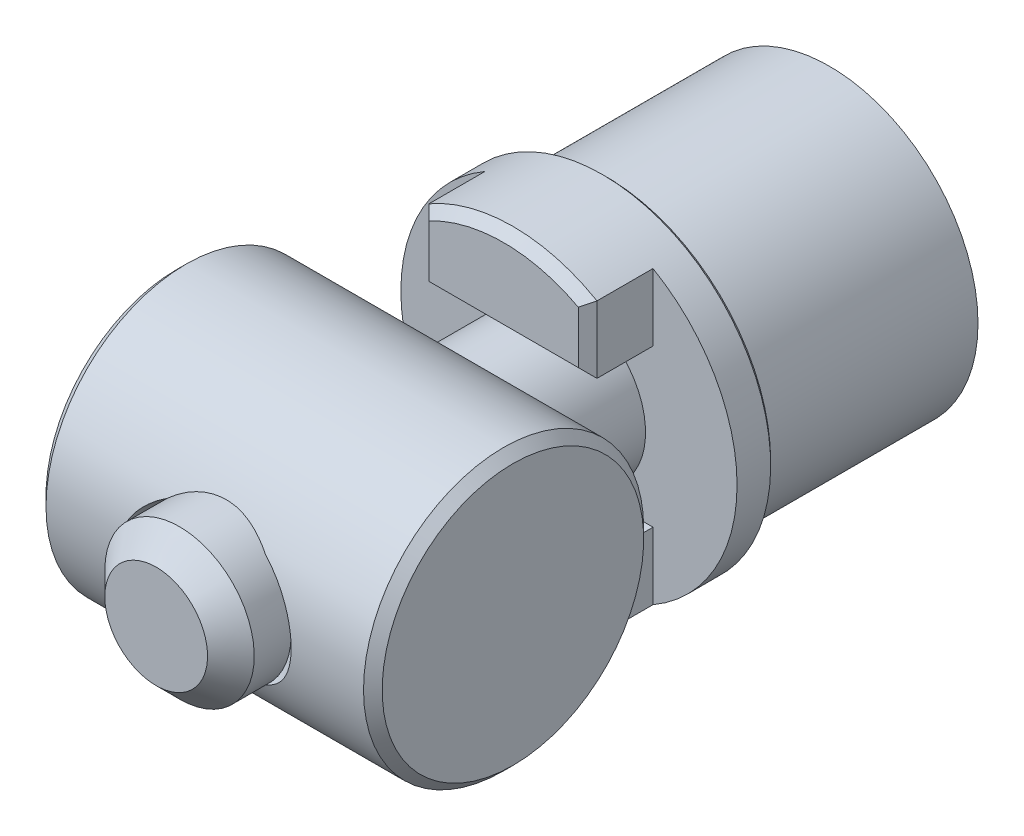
ISO-10303-21;
HEADER;
FILE_DESCRIPTION(('STEP AP214'),'2;1');
FILE_NAME('part.step','',(''),(''),'','','');
FILE_SCHEMA(('AUTOMOTIVE_DESIGN { 1 0 10303 214 1 1 1 1 }'));
ENDSEC;
DATA;
#1=APPLICATION_CONTEXT('core data for automotive mechanical design processes');
#2=APPLICATION_PROTOCOL_DEFINITION('international standard','automotive_design',2000,#1);
#3=PRODUCT_CONTEXT('',#1,'mechanical');
#4=PRODUCT('Part','Part','',(#3));
#5=PRODUCT_RELATED_PRODUCT_CATEGORY('part','',(#4));
#6=PRODUCT_DEFINITION_FORMATION('','',#4);
#7=PRODUCT_DEFINITION_CONTEXT('part definition',#1,'design');
#8=PRODUCT_DEFINITION('design','',#6,#7);
#9=PRODUCT_DEFINITION_SHAPE('','',#8);
#10=(LENGTH_UNIT() NAMED_UNIT(*) SI_UNIT(.MILLI.,.METRE.));
#11=(NAMED_UNIT(*) PLANE_ANGLE_UNIT() SI_UNIT($,.RADIAN.));
#12=(NAMED_UNIT(*) SI_UNIT($,.STERADIAN.) SOLID_ANGLE_UNIT());
#13=UNCERTAINTY_MEASURE_WITH_UNIT(LENGTH_MEASURE(1.E-05),#10,'distance_accuracy_value','');
#14=(GEOMETRIC_REPRESENTATION_CONTEXT(3) GLOBAL_UNCERTAINTY_ASSIGNED_CONTEXT((#13)) GLOBAL_UNIT_ASSIGNED_CONTEXT((#10,
#11,#12)) REPRESENTATION_CONTEXT('',''));
#15=CARTESIAN_POINT('',(0.,0.,0.));
#16=DIRECTION('',(0.,0.,1.));
#17=DIRECTION('',(1.,0.,0.));
#18=AXIS2_PLACEMENT_3D('',#15,#16,#17);
#19=CARTESIAN_POINT('',(0.,1.08404297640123E-13,-18.95));
#20=DIRECTION('',(0.,0.,-1.));
#21=DIRECTION('',(1.,0.,0.));
#22=AXIS2_PLACEMENT_3D('',#19,#20,#21);
#23=CYLINDRICAL_SURFACE('',#22,4.);
#24=CARTESIAN_POINT('',(0.,1.17710063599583E-13,19.075));
#25=DIRECTION('',(0.,0.,-1.));
#26=DIRECTION('',(0.,-1.,0.));
#27=AXIS2_PLACEMENT_3D('',#24,#25,#26);
#28=CIRCLE('',#27,4.);
#29=CARTESIAN_POINT('',(2.64870251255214,-2.99739470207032,19.075));
#30=VERTEX_POINT('',#29);
#31=CARTESIAN_POINT('',(2.64870251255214,2.99739470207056,19.075));
#32=VERTEX_POINT('',#31);
#33=EDGE_CURVE('E263',#30,#32,#28,.F.);
#34=ORIENTED_EDGE('',*,*,#33,.F.);
#35=CARTESIAN_POINT('',(4.,1.19604588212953E-13,18.45));
#36=CARTESIAN_POINT('',(4.00000040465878,0.10432928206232,18.4499996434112));
#37=CARTESIAN_POINT('',(3.99591393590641,0.208652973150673,18.4521816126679));
#38=CARTESIAN_POINT('',(3.97962111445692,0.416519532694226,18.4608520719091));
#39=CARTESIAN_POINT('',(3.96741197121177,0.520062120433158,18.4673420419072));
#40=CARTESIAN_POINT('',(3.93500361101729,0.725661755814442,18.4844750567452));
#41=CARTESIAN_POINT('',(3.91479547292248,0.827717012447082,18.4951227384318));
#42=CARTESIAN_POINT('',(3.86663812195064,1.02950974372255,18.520297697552));
#43=CARTESIAN_POINT('',(3.83868574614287,1.12924625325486,18.5348265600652));
#44=CARTESIAN_POINT('',(3.74392721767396,1.4230748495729,18.5835888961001));
#45=CARTESIAN_POINT('',(3.66604732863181,1.6128561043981,18.6230927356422));
#46=CARTESIAN_POINT('',(3.48368084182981,1.97620882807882,18.712614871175));
#47=CARTESIAN_POINT('',(3.37919412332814,2.1497802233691,18.7626332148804));
#48=CARTESIAN_POINT('',(3.13874131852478,2.48882838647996,18.8726047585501));
#49=CARTESIAN_POINT('',(3.00115110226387,2.65301196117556,18.9329960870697));
#50=CARTESIAN_POINT('',(2.70199516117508,2.95716832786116,19.0556460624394));
#51=CARTESIAN_POINT('',(2.54040866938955,3.09711991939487,19.1179062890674));
#52=CARTESIAN_POINT('',(2.18006310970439,3.3617890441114,19.2439011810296));
#53=CARTESIAN_POINT('',(1.97925783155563,3.48395288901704,19.30725239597));
#54=CARTESIAN_POINT('',(1.66233743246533,3.64013044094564,19.3923340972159));
#55=CARTESIAN_POINT('',(1.55404047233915,3.6876894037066,19.4190442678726));
#56=CARTESIAN_POINT('',(1.33282028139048,3.7732780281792,19.4681172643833));
#57=CARTESIAN_POINT('',(1.21990000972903,3.81131367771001,19.4904828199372));
#58=CARTESIAN_POINT('',(0.997366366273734,3.87528400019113,19.5286701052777));
#59=CARTESIAN_POINT('',(0.887981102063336,3.90182208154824,19.5448112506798));
#60=CARTESIAN_POINT('',(0.666772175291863,3.94564516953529,19.5717127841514));
#61=CARTESIAN_POINT('',(0.55494993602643,3.96293543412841,19.5824762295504));
#62=CARTESIAN_POINT('',(0.329923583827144,3.98797639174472,19.5981290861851));
#63=CARTESIAN_POINT('',(0.216720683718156,3.99573492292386,19.6030233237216));
#64=CARTESIAN_POINT('',(-0.0100266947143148,4.00159448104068,19.6067157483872));
#65=CARTESIAN_POINT('',(-0.123571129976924,3.99969667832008,19.6055146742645));
#66=CARTESIAN_POINT('',(-0.3338804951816,3.98722972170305,19.5976743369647));
#67=CARTESIAN_POINT('',(-0.430752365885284,3.97792191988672,19.5918263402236));
#68=CARTESIAN_POINT('',(-0.623229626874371,3.95234427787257,19.5758966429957));
#69=CARTESIAN_POINT('',(-0.718834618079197,3.93607229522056,19.5658136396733));
#70=CARTESIAN_POINT('',(-1.0027672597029,3.87707963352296,19.5296851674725));
#71=CARTESIAN_POINT('',(-1.18833960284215,3.82417439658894,19.4977548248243));
#72=CARTESIAN_POINT('',(-1.55171916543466,3.69194831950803,19.4211859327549));
#73=CARTESIAN_POINT('',(-1.72925828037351,3.61206074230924,19.3762780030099));
#74=CARTESIAN_POINT('',(-2.06934086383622,3.4285815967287,19.2787472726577));
#75=CARTESIAN_POINT('',(-2.23187764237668,3.32497952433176,19.2261210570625));
#76=CARTESIAN_POINT('',(-2.56242703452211,3.07935066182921,19.1097756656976));
#77=CARTESIAN_POINT('',(-2.7277350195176,2.93391468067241,19.0455627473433));
#78=CARTESIAN_POINT('',(-3.03289545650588,2.61722362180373,18.9194143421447));
#79=CARTESIAN_POINT('',(-3.17273237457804,2.44595290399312,18.8574802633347));
#80=CARTESIAN_POINT('',(-3.36435932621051,2.16676749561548,18.7690899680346));
#81=CARTESIAN_POINT('',(-3.42666004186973,2.06686725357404,18.7396306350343));
#82=CARTESIAN_POINT('',(-3.54252047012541,1.86130318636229,18.6838546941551));
#83=CARTESIAN_POINT('',(-3.5960839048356,1.75564184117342,18.6575367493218));
#84=CARTESIAN_POINT('',(-3.69387554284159,1.53927716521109,18.60882020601));
#85=CARTESIAN_POINT('',(-3.73810813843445,1.42857623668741,18.5864197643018));
#86=CARTESIAN_POINT('',(-3.81670749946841,1.20291776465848,18.5462094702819));
#87=CARTESIAN_POINT('',(-3.85107557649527,1.08796078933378,18.5283990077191));
#88=CARTESIAN_POINT('',(-3.90682600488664,0.865261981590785,18.49931026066));
#89=CARTESIAN_POINT('',(-3.92909777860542,0.757800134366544,18.4875887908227));
#90=CARTESIAN_POINT('',(-3.96476496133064,0.541018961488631,18.4687480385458));
#91=CARTESIAN_POINT('',(-3.97816130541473,0.431699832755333,18.4616282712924));
#92=CARTESIAN_POINT('',(-3.99588587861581,0.212172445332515,18.4521971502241));
#93=CARTESIAN_POINT('',(-4.00021829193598,0.101964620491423,18.4498835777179));
#94=CARTESIAN_POINT('',(-3.99976477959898,-0.118422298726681,18.4501254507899));
#95=CARTESIAN_POINT('',(-3.99497937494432,-0.228601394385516,18.4526806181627));
#96=CARTESIAN_POINT('',(-3.97720766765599,-0.437982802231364,18.4621345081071));
#97=CARTESIAN_POINT('',(-3.96500748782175,-0.537271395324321,18.4686166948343));
#98=CARTESIAN_POINT('',(-3.93328142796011,-0.734354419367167,18.4853815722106));
#99=CARTESIAN_POINT('',(-3.91375325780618,-0.832148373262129,18.4956654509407));
#100=CARTESIAN_POINT('',(-3.84447795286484,-1.12223852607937,18.5318864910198));
#101=CARTESIAN_POINT('',(-3.78402368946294,-1.31143028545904,18.5632021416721));
#102=CARTESIAN_POINT('',(-3.63512086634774,-1.68128124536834,18.6383726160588));
#103=CARTESIAN_POINT('',(-3.54601184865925,-1.86161005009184,18.6825206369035));
#104=CARTESIAN_POINT('',(-3.34312620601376,-2.20530240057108,18.7793277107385));
#105=CARTESIAN_POINT('',(-3.22933995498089,-2.3686592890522,18.8319900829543));
#106=CARTESIAN_POINT('',(-2.9662721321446,-2.6924516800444,18.9476181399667));
#107=CARTESIAN_POINT('',(-2.81448780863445,-2.85067860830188,19.0110826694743));
#108=CARTESIAN_POINT('',(-2.48694968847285,-3.1405450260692,19.1373632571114));
#109=CARTESIAN_POINT('',(-2.31117393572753,-3.27215988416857,19.200178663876));
#110=CARTESIAN_POINT('',(-1.92581246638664,-3.51371844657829,19.3225294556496));
#111=CARTESIAN_POINT('',(-1.71474727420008,-3.62160676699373,19.3815593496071));
#112=CARTESIAN_POINT('',(-1.38408550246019,-3.75479280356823,19.4573783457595));
#113=CARTESIAN_POINT('',(-1.27152857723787,-3.7944121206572,19.4805292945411));
#114=CARTESIAN_POINT('',(-1.04241683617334,-3.86363310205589,19.5216281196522));
#115=CARTESIAN_POINT('',(-0.925862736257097,-3.89323655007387,19.539576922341));
#116=CARTESIAN_POINT('',(-0.70137676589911,-3.93952982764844,19.5679339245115));
#117=CARTESIAN_POINT('',(-0.593717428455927,-3.95719994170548,19.5789081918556));
#118=CARTESIAN_POINT('',(-0.376909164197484,-3.98369950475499,19.5954438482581));
#119=CARTESIAN_POINT('',(-0.267760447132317,-3.99253018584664,19.6010059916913));
#120=CARTESIAN_POINT('',(-0.0490176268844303,-4.00119558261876,19.606462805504));
#121=CARTESIAN_POINT('',(0.0605762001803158,-4.00103521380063,19.6063605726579));
#122=CARTESIAN_POINT('',(0.279197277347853,-3.99174615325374,19.6005134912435));
#123=CARTESIAN_POINT('',(0.388224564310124,-3.98261805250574,19.5947690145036));
#124=CARTESIAN_POINT('',(0.686594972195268,-3.94527417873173,19.5714671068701));
#125=CARTESIAN_POINT('',(0.874437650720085,-3.90785104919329,19.5482657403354));
#126=CARTESIAN_POINT('',(1.24070660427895,-3.80746909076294,19.4880708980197));
#127=CARTESIAN_POINT('',(1.41912935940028,-3.74450079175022,19.451072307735));
#128=CARTESIAN_POINT('',(1.77451283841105,-3.59040170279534,19.3646152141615));
#129=CARTESIAN_POINT('',(1.95063888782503,-3.49771796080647,19.3145075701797));
#130=CARTESIAN_POINT('',(2.28601363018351,-3.28835420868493,19.2083019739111));
#131=CARTESIAN_POINT('',(2.44525316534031,-3.17166127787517,19.1522008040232));
#132=CARTESIAN_POINT('',(2.76636004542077,-2.89792689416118,19.0306381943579));
#133=CARTESIAN_POINT('',(2.92527561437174,-2.73749066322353,18.9649966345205));
#134=CARTESIAN_POINT('',(3.2148794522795,-2.39071522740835,18.83885125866));
#135=CARTESIAN_POINT('',(3.34554944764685,-2.20435938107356,18.7783507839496));
#136=CARTESIAN_POINT('',(3.51859665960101,-1.90608771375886,18.6954908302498));
#137=CARTESIAN_POINT('',(3.57297318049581,-1.80214051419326,18.6689100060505));
#138=CARTESIAN_POINT('',(3.67265414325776,-1.58915491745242,18.6194810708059));
#139=CARTESIAN_POINT('',(3.71796305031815,-1.48011905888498,18.5966311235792));
#140=CARTESIAN_POINT('',(3.79888380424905,-1.25794839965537,18.5553864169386));
#141=CARTESIAN_POINT('',(3.83451515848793,-1.14482237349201,18.5369827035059));
#142=CARTESIAN_POINT('',(3.89569281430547,-0.915246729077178,18.5051535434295));
#143=CARTESIAN_POINT('',(3.92124470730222,-0.798798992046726,18.4917253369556));
#144=CARTESIAN_POINT('',(3.96094679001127,-0.569078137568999,18.4707734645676));
#145=CARTESIAN_POINT('',(3.97557224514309,-0.455909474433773,18.4630040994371));
#146=CARTESIAN_POINT('',(3.99509868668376,-0.228491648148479,18.4526175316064));
#147=CARTESIAN_POINT('',(3.99999955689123,-0.114242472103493,18.4500003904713));
#148=CARTESIAN_POINT('',(4.,1.19604588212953E-13,18.45));
#149=B_SPLINE_CURVE_WITH_KNOTS('',3,(#35,#36,#37,#38,#39,#40,#41,#42,#43,#44,#45,#46,#47,#48,
#49,#50,#51,#52,#53,#54,#55,#56,#57,#58,#59,#60,#61,#62,#63,#64,#65,#66,#67,#68,#69,#70,#71,#72,
#73,#74,#75,#76,#77,#78,#79,#80,#81,#82,#83,#84,#85,#86,#87,#88,#89,#90,#91,#92,#93,#94,#95,#96,
#97,#98,#99,#100,#101,#102,#103,#104,#105,#106,#107,#108,#109,#110,#111,#112,#113,#114,#115,
#116,#117,#118,#119,#120,#121,#122,#123,#124,#125,#126,#127,#128,#129,#130,#131,#132,#133,#134,
#135,#136,#137,#138,#139,#140,#141,#142,#143,#144,#145,#146,#147,#148),.UNSPECIFIED.,.T.,.F.,(4,
2,2,2,2,2,2,2,2,2,2,2,2,2,2,2,2,2,2,2,2,2,2,2,2,2,2,2,2,2,2,2,2,2,2,2,2,2,2,2,2,2,2,2,2,2,2,2,2,
2,2,2,2,2,2,2,4),(0.,0.312875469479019,0.625858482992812,0.939191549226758,1.25265277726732,
1.87635275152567,2.50005555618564,3.16498046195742,3.83048419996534,4.55668682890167,
4.92002643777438,5.28313701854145,5.62376635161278,5.96420180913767,6.30435713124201,
6.64447122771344,6.9365937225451,7.2288061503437,7.81285364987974,8.41002203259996,
9.00745543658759,9.69267368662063,10.3783084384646,10.7419894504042,11.1055151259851,
11.4688692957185,11.832175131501,12.1628321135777,12.4934542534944,12.8239237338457,
13.1543743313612,13.4547461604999,13.7552119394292,14.3555858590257,14.9709302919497,
15.5865151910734,16.2683843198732,16.9508817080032,17.6793249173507,18.0434998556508,
18.407609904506,18.736085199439,19.0645147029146,19.3927646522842,19.720992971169,
20.2969971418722,20.8732150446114,21.4865540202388,22.1002239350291,22.8026614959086,
23.5055521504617,23.8659835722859,24.2262370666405,24.5857589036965,24.9450810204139,
25.2876812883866,25.6302856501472),.UNSPECIFIED.);
#150=CARTESIAN_POINT('',(-2.64870251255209,-2.99739470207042,19.075));
#151=VERTEX_POINT('',#150);
#152=EDGE_CURVE('E441',#151,#30,#149,.T.);
#153=ORIENTED_EDGE('',*,*,#152,.F.);
#154=CARTESIAN_POINT('',(-2.64870251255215,2.99739470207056,19.075));
#155=VERTEX_POINT('',#154);
#156=EDGE_CURVE('E260',#155,#151,#28,.F.);
#157=ORIENTED_EDGE('',*,*,#156,.F.);
#158=EDGE_CURVE('E33',#32,#155,#149,.T.);
#159=ORIENTED_EDGE('',*,*,#158,.F.);
#160=EDGE_LOOP('',(#34,#153,#157,#159));
#161=FACE_BOUND('',#160,.T.);
#162=CARTESIAN_POINT('',(0.,1.17879269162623E-13,11.95));
#163=DIRECTION('',(0.,0.,-1.));
#164=DIRECTION('',(-1.,0.,0.));
#165=AXIS2_PLACEMENT_3D('',#162,#163,#164);
#166=CIRCLE('',#165,4.);
#167=CARTESIAN_POINT('',(-3.99999999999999,1.17879269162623E-13,11.95));
#168=VERTEX_POINT('',#167);
#169=EDGE_CURVE('E373',#168,#168,#166,.F.);
#170=ORIENTED_EDGE('',*,*,#169,.T.);
#171=EDGE_LOOP('',(#170));
#172=FACE_BOUND('',#171,.T.);
#173=ADVANCED_FACE('F14',(#161,#172),#23,.T.);
#174=CARTESIAN_POINT('',(-9.,1.29526717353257E-13,25.95));
#175=DIRECTION('',(-1.,0.,0.));
#176=DIRECTION('',(0.,1.,0.));
#177=AXIS2_PLACEMENT_3D('',#174,#175,#176);
#178=CONICAL_SURFACE('',#177,2.9,0.785398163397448);
#179=CARTESIAN_POINT('',(-9.,1.29526717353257E-13,25.95));
#180=DIRECTION('',(-1.,0.,0.));
#181=DIRECTION('',(0.,1.,0.));
#182=AXIS2_PLACEMENT_3D('',#179,#180,#181);
#183=CIRCLE('',#182,2.9);
#184=CARTESIAN_POINT('',(-9.,2.90000000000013,25.95));
#185=VERTEX_POINT('',#184);
#186=EDGE_CURVE('E140',#185,#185,#183,.T.);
#187=ORIENTED_EDGE('',*,*,#186,.T.);
#188=EDGE_LOOP('',(#187));
#189=FACE_BOUND('',#188,.T.);
#190=CARTESIAN_POINT('',(-8.6,1.29655368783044E-13,25.95));
#191=DIRECTION('',(-1.,0.,0.));
#192=DIRECTION('',(0.,0.,1.));
#193=AXIS2_PLACEMENT_3D('',#190,#191,#192);
#194=CIRCLE('',#193,2.5);
#195=CARTESIAN_POINT('',(-8.59999999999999,1.3033547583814E-13,28.45));
#196=VERTEX_POINT('',#195);
#197=EDGE_CURVE('E136',#196,#196,#194,.F.);
#198=ORIENTED_EDGE('',*,*,#197,.T.);
#199=EDGE_LOOP('',(#198));
#200=FACE_BOUND('',#199,.T.);
#201=ADVANCED_FACE('F182',(#189,#200),#178,.F.);
#202=CARTESIAN_POINT('',(0.,1.24885841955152E-13,34.8));
#203=DIRECTION('',(0.,0.,1.));
#204=DIRECTION('',(-1.,0.,0.));
#205=AXIS2_PLACEMENT_3D('',#202,#203,#204);
#206=CIRCLE('',#205,4.);
#207=CARTESIAN_POINT('',(-3.99999999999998,1.25153639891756E-13,34.8));
#208=VERTEX_POINT('',#207);
#209=EDGE_CURVE('E24',#208,#208,#206,.F.);
#210=ORIENTED_EDGE('',*,*,#209,.T.);
#211=EDGE_LOOP('',(#210));
#212=FACE_BOUND('',#211,.T.);
#213=CARTESIAN_POINT('',(0.,1.47183778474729E-13,32.825));
#214=DIRECTION('',(0.,0.,1.));
#215=DIRECTION('',(0.,1.,0.));
#216=AXIS2_PLACEMENT_3D('',#213,#214,#215);
#217=CIRCLE('',#216,4.);
#218=CARTESIAN_POINT('',(2.64870251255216,2.99739470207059,32.825));
#219=VERTEX_POINT('',#218);
#220=CARTESIAN_POINT('',(2.64870251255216,-2.99739470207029,32.825));
#221=VERTEX_POINT('',#220);
#222=EDGE_CURVE('E251',#219,#221,#217,.F.);
#223=ORIENTED_EDGE('',*,*,#222,.F.);
#224=CARTESIAN_POINT('',(4.,1.24204088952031E-13,33.45));
#225=CARTESIAN_POINT('',(4.00000040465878,-0.104329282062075,33.4500003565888));
#226=CARTESIAN_POINT('',(3.99591393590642,-0.208652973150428,33.447818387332));
#227=CARTESIAN_POINT('',(3.97962111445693,-0.41651953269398,33.4391479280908));
#228=CARTESIAN_POINT('',(3.96741197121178,-0.520062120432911,33.4326579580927));
#229=CARTESIAN_POINT('',(3.9350036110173,-0.725661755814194,33.4155249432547));
#230=CARTESIAN_POINT('',(3.9147954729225,-0.827717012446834,33.4048772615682));
#231=CARTESIAN_POINT('',(3.86663812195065,-1.0295097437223,33.379702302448));
#232=CARTESIAN_POINT('',(3.83868574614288,-1.12924625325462,33.3651734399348));
#233=CARTESIAN_POINT('',(3.74392721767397,-1.42307484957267,33.3164111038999));
#234=CARTESIAN_POINT('',(3.66604732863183,-1.61285610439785,33.2769072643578));
#235=CARTESIAN_POINT('',(3.48368084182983,-1.97620882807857,33.1873851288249));
#236=CARTESIAN_POINT('',(3.37919412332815,-2.14978022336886,33.1373667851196));
#237=CARTESIAN_POINT('',(3.13874131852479,-2.48882838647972,33.0273952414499));
#238=CARTESIAN_POINT('',(3.00115110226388,-2.65301196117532,32.9670039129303));
#239=CARTESIAN_POINT('',(2.7019951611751,-2.95716832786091,32.8443539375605));
#240=CARTESIAN_POINT('',(2.54040866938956,-3.09711991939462,32.7820937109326));
#241=CARTESIAN_POINT('',(2.1800631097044,-3.36178904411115,32.6560988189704));
#242=CARTESIAN_POINT('',(1.97925783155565,-3.4839528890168,32.59274760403));
#243=CARTESIAN_POINT('',(1.66233743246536,-3.64013044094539,32.507665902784));
#244=CARTESIAN_POINT('',(1.55404047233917,-3.68768940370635,32.4809557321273));
#245=CARTESIAN_POINT('',(1.3328202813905,-3.77327802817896,32.4318827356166));
#246=CARTESIAN_POINT('',(1.21990000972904,-3.81131367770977,32.4095171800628));
#247=CARTESIAN_POINT('',(0.997366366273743,-3.87528400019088,32.3713298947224));
#248=CARTESIAN_POINT('',(0.88798110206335,-3.901822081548,32.3551887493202));
#249=CARTESIAN_POINT('',(0.666772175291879,-3.94564516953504,32.3282872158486));
#250=CARTESIAN_POINT('',(0.554949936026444,-3.96293543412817,32.3175237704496));
#251=CARTESIAN_POINT('',(0.329923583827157,-3.98797639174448,32.3018709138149));
#252=CARTESIAN_POINT('',(0.216720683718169,-3.99573492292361,32.2969766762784));
#253=CARTESIAN_POINT('',(-0.0100266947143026,-4.00159448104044,32.2932842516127));
#254=CARTESIAN_POINT('',(-0.123571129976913,-3.99969667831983,32.2944853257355));
#255=CARTESIAN_POINT('',(-0.333880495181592,-3.9872297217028,32.3023256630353));
#256=CARTESIAN_POINT('',(-0.430752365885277,-3.97792191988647,32.3081736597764));
#257=CARTESIAN_POINT('',(-0.623229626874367,-3.95234427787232,32.3241033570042));
#258=CARTESIAN_POINT('',(-0.718834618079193,-3.93607229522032,32.3341863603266));
#259=CARTESIAN_POINT('',(-1.0027672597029,-3.87707963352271,32.3703148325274));
#260=CARTESIAN_POINT('',(-1.18833960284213,-3.82417439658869,32.4022451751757));
#261=CARTESIAN_POINT('',(-1.55171916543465,-3.69194831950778,32.4788140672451));
#262=CARTESIAN_POINT('',(-1.7292582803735,-3.61206074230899,32.5237219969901));
#263=CARTESIAN_POINT('',(-2.06934086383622,-3.42858159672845,32.6212527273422));
#264=CARTESIAN_POINT('',(-2.23187764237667,-3.32497952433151,32.6738789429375));
#265=CARTESIAN_POINT('',(-2.56242703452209,-3.07935066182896,32.7902243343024));
#266=CARTESIAN_POINT('',(-2.72773501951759,-2.93391468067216,32.8544372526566));
#267=CARTESIAN_POINT('',(-3.03289545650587,-2.61722362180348,32.9805856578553));
#268=CARTESIAN_POINT('',(-3.17273237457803,-2.44595290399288,33.0425197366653));
#269=CARTESIAN_POINT('',(-3.36435932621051,-2.16676749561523,33.1309100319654));
#270=CARTESIAN_POINT('',(-3.42666004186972,-2.06686725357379,33.1603693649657));
#271=CARTESIAN_POINT('',(-3.54252047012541,-1.86130318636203,33.2161453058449));
#272=CARTESIAN_POINT('',(-3.59608390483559,-1.75564184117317,33.2424632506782));
#273=CARTESIAN_POINT('',(-3.69387554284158,-1.53927716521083,33.29117979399));
#274=CARTESIAN_POINT('',(-3.73810813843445,-1.42857623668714,33.3135802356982));
#275=CARTESIAN_POINT('',(-3.8167074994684,-1.20291776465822,33.3537905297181));
#276=CARTESIAN_POINT('',(-3.85107557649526,-1.08796078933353,33.371600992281));
#277=CARTESIAN_POINT('',(-3.90682600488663,-0.865261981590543,33.4006897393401));
#278=CARTESIAN_POINT('',(-3.9290977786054,-0.757800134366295,33.4124112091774));
#279=CARTESIAN_POINT('',(-3.96476496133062,-0.54101896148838,33.4312519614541));
#280=CARTESIAN_POINT('',(-3.97816130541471,-0.431699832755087,33.4383717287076));
#281=CARTESIAN_POINT('',(-3.9958858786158,-0.212172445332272,33.4478028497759));
#282=CARTESIAN_POINT('',(-4.00021829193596,-0.101964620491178,33.4501164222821));
#283=CARTESIAN_POINT('',(-3.99976477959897,0.118422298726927,33.4498745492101));
#284=CARTESIAN_POINT('',(-3.9949793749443,0.228601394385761,33.4473193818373));
#285=CARTESIAN_POINT('',(-3.97720766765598,0.437982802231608,33.4378654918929));
#286=CARTESIAN_POINT('',(-3.96500748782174,0.537271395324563,33.4313833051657));
#287=CARTESIAN_POINT('',(-3.93328142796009,0.734354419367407,33.4146184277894));
#288=CARTESIAN_POINT('',(-3.91375325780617,0.832148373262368,33.4043345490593));
#289=CARTESIAN_POINT('',(-3.84447795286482,1.12223852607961,33.3681135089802));
#290=CARTESIAN_POINT('',(-3.78402368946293,1.31143028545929,33.336797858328));
#291=CARTESIAN_POINT('',(-3.63512086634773,1.68128124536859,33.2616273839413));
#292=CARTESIAN_POINT('',(-3.54601184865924,1.86161005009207,33.2174793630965));
#293=CARTESIAN_POINT('',(-3.34312620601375,2.20530240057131,33.1206722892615));
#294=CARTESIAN_POINT('',(-3.22933995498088,2.36865928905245,33.0680099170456));
#295=CARTESIAN_POINT('',(-2.96627213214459,2.69245168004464,32.9523818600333));
#296=CARTESIAN_POINT('',(-2.81448780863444,2.85067860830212,32.8889173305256));
#297=CARTESIAN_POINT('',(-2.48694968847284,3.14054502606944,32.7626367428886));
#298=CARTESIAN_POINT('',(-2.31117393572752,3.27215988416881,32.699821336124));
#299=CARTESIAN_POINT('',(-1.92581246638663,3.51371844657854,32.5774705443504));
#300=CARTESIAN_POINT('',(-1.71474727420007,3.62160676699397,32.5184406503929));
#301=CARTESIAN_POINT('',(-1.38408550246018,3.75479280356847,32.4426216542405));
#302=CARTESIAN_POINT('',(-1.27152857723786,3.79441212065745,32.4194707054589));
#303=CARTESIAN_POINT('',(-1.04241683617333,3.86363310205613,32.3783718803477));
#304=CARTESIAN_POINT('',(-0.925862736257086,3.89323655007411,32.360423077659));
#305=CARTESIAN_POINT('',(-0.7013767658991,3.93952982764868,32.3320660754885));
#306=CARTESIAN_POINT('',(-0.593717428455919,3.95719994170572,32.3210918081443));
#307=CARTESIAN_POINT('',(-0.376909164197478,3.98369950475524,32.3045561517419));
#308=CARTESIAN_POINT('',(-0.267760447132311,3.99253018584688,32.2989940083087));
#309=CARTESIAN_POINT('',(-0.0490176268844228,4.00119558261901,32.293537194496));
#310=CARTESIAN_POINT('',(0.0605762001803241,4.00103521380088,32.2936394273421));
#311=CARTESIAN_POINT('',(0.279197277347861,3.99174615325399,32.2994865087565));
#312=CARTESIAN_POINT('',(0.388224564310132,3.98261805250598,32.3052309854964));
#313=CARTESIAN_POINT('',(0.686594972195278,3.94527417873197,32.3285328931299));
#314=CARTESIAN_POINT('',(0.874437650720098,3.90785104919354,32.3517342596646));
#315=CARTESIAN_POINT('',(1.24070660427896,3.80746909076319,32.4119291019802));
#316=CARTESIAN_POINT('',(1.41912935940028,3.74450079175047,32.448927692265));
#317=CARTESIAN_POINT('',(1.77451283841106,3.59040170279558,32.5353847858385));
#318=CARTESIAN_POINT('',(1.95063888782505,3.49771796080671,32.5854924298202));
#319=CARTESIAN_POINT('',(2.28601363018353,3.28835420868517,32.6916980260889));
#320=CARTESIAN_POINT('',(2.44525316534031,3.17166127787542,32.7477991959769));
#321=CARTESIAN_POINT('',(2.76636004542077,2.89792689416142,32.8693618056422));
#322=CARTESIAN_POINT('',(2.92527561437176,2.73749066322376,32.9350033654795));
#323=CARTESIAN_POINT('',(3.21487945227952,2.39071522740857,33.06114874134));
#324=CARTESIAN_POINT('',(3.34554944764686,2.20435938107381,33.1216492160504));
#325=CARTESIAN_POINT('',(3.51859665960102,1.90608771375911,33.2045091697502));
#326=CARTESIAN_POINT('',(3.57297318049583,1.80214051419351,33.2310899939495));
#327=CARTESIAN_POINT('',(3.67265414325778,1.58915491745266,33.280518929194));
#328=CARTESIAN_POINT('',(3.71796305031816,1.48011905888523,33.3033688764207));
#329=CARTESIAN_POINT('',(3.79888380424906,1.25794839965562,33.3446135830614));
#330=CARTESIAN_POINT('',(3.83451515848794,1.14482237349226,33.3630172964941));
#331=CARTESIAN_POINT('',(3.89569281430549,0.915246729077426,33.3948464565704));
#332=CARTESIAN_POINT('',(3.92124470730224,0.798798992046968,33.4082746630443));
#333=CARTESIAN_POINT('',(3.96094679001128,0.569078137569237,33.4292265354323));
#334=CARTESIAN_POINT('',(3.9755722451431,0.455909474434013,33.4369959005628));
#335=CARTESIAN_POINT('',(3.99509868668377,0.228491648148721,33.4473824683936));
#336=CARTESIAN_POINT('',(3.99999955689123,0.114242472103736,33.4499996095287));
#337=CARTESIAN_POINT('',(4.,1.24204088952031E-13,33.45));
#338=B_SPLINE_CURVE_WITH_KNOTS('',3,(#224,#225,#226,#227,#228,#229,#230,#231,#232,#233,#234,
#235,#236,#237,#238,#239,#240,#241,#242,#243,#244,#245,#246,#247,#248,#249,#250,#251,#252,#253,
#254,#255,#256,#257,#258,#259,#260,#261,#262,#263,#264,#265,#266,#267,#268,#269,#270,#271,#272,
#273,#274,#275,#276,#277,#278,#279,#280,#281,#282,#283,#284,#285,#286,#287,#288,#289,#290,#291,
#292,#293,#294,#295,#296,#297,#298,#299,#300,#301,#302,#303,#304,#305,#306,#307,#308,#309,#310,
#311,#312,#313,#314,#315,#316,#317,#318,#319,#320,#321,#322,#323,#324,#325,#326,#327,#328,#329,
#330,#331,#332,#333,#334,#335,#336,#337),.UNSPECIFIED.,.T.,.F.,(4,2,2,2,2,2,2,2,2,2,2,2,2,2,2,2,
2,2,2,2,2,2,2,2,2,2,2,2,2,2,2,2,2,2,2,2,2,2,2,2,2,2,2,2,2,2,2,2,2,2,2,2,2,2,2,2,4),(0.,
0.312875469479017,0.625858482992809,0.939191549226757,1.25265277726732,1.87635275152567,
2.50005555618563,3.16498046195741,3.83048419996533,4.55668682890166,4.92002643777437,
5.28313701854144,5.62376635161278,5.96420180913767,6.30435713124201,6.64447122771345,
6.9365937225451,7.2288061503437,7.81285364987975,8.41002203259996,9.00745543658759,
9.69267368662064,10.3783084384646,10.7419894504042,11.1055151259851,11.4688692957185,
11.832175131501,12.1628321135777,12.4934542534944,12.8239237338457,13.1543743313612,
13.4547461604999,13.7552119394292,14.3555858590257,14.9709302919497,15.5865151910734,
16.2683843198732,16.9508817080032,17.6793249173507,18.0434998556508,18.407609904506,
18.736085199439,19.0645147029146,19.3927646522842,19.720992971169,20.2969971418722,
20.8732150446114,21.4865540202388,22.1002239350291,22.8026614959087,23.5055521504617,
23.8659835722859,24.2262370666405,24.5857589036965,24.9450810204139,25.2876812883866,
25.6302856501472),.UNSPECIFIED.);
#339=CARTESIAN_POINT('',(-2.64870251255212,2.99739470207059,32.825));
#340=VERTEX_POINT('',#339);
#341=EDGE_CURVE('E887',#340,#219,#338,.T.);
#342=ORIENTED_EDGE('',*,*,#341,.F.);
#343=CARTESIAN_POINT('',(-2.64870251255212,-2.9973947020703,32.825));
#344=VERTEX_POINT('',#343);
#345=EDGE_CURVE('E267',#344,#340,#217,.F.);
#346=ORIENTED_EDGE('',*,*,#345,.F.);
#347=EDGE_CURVE('E113',#221,#344,#338,.T.);
#348=ORIENTED_EDGE('',*,*,#347,.F.);
#349=EDGE_LOOP('',(#223,#342,#346,#348));
#350=FACE_BOUND('',#349,.T.);
#351=ADVANCED_FACE('F185',(#212,#350),#23,.T.);
#352=CARTESIAN_POINT('',(0.,1.25269133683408E-13,36.05));
#353=DIRECTION('',(0.,0.,1.));
#354=DIRECTION('',(-1.,0.,0.));
#355=AXIS2_PLACEMENT_3D('',#352,#353,#354);
#356=PLANE('',#355);
#357=CARTESIAN_POINT('',(0.,1.25269133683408E-13,36.05));
#358=DIRECTION('',(0.,0.,1.));
#359=DIRECTION('',(-1.,0.,0.));
#360=AXIS2_PLACEMENT_3D('',#357,#358,#359);
#361=CIRCLE('',#360,2.75);
#362=CARTESIAN_POINT('',(-2.74999999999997,1.25453244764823E-13,36.05));
#363=VERTEX_POINT('',#362);
#364=EDGE_CURVE('E9',#363,#363,#361,.T.);
#365=ORIENTED_EDGE('',*,*,#364,.T.);
#366=EDGE_LOOP('',(#365));
#367=FACE_BOUND('',#366,.T.);
#368=ADVANCED_FACE('F230',(#367),#356,.T.);
#369=CARTESIAN_POINT('',(0.,1.25269133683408E-13,36.05));
#370=DIRECTION('',(0.,0.,-1.));
#371=DIRECTION('',(1.,0.,0.));
#372=AXIS2_PLACEMENT_3D('',#369,#370,#371);
#373=CONICAL_SURFACE('',#372,2.75,0.785398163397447);
#374=ORIENTED_EDGE('',*,*,#209,.F.);
#375=EDGE_LOOP('',(#374));
#376=FACE_BOUND('',#375,.T.);
#377=ORIENTED_EDGE('',*,*,#364,.F.);
#378=EDGE_LOOP('',(#377));
#379=FACE_BOUND('',#378,.T.);
#380=ADVANCED_FACE('F194',(#376,#379),#373,.T.);
#381=CARTESIAN_POINT('',(-9.,1.29526717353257E-13,25.95));
#382=DIRECTION('',(-1.,0.,0.));
#383=DIRECTION('',(0.,1.,0.));
#384=AXIS2_PLACEMENT_3D('',#381,#382,#383);
#385=PLANE('',#384);
#386=ORIENTED_EDGE('',*,*,#186,.F.);
#387=EDGE_LOOP('',(#386));
#388=FACE_BOUND('',#387,.T.);
#389=CARTESIAN_POINT('',(-9.,1.29526717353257E-13,25.95));
#390=DIRECTION('',(-1.,0.,0.));
#391=DIRECTION('',(0.,1.,0.));
#392=AXIS2_PLACEMENT_3D('',#389,#390,#391);
#393=CIRCLE('',#392,7.);
#394=CARTESIAN_POINT('',(-9.,7.00000000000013,25.95));
#395=VERTEX_POINT('',#394);
#396=EDGE_CURVE('E152',#395,#395,#393,.T.);
#397=ORIENTED_EDGE('',*,*,#396,.T.);
#398=EDGE_LOOP('',(#397));
#399=FACE_BOUND('',#398,.T.);
#400=ADVANCED_FACE('F187',(#388,#399),#385,.T.);
#401=CARTESIAN_POINT('',(9.,1.35316031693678E-13,25.95));
#402=DIRECTION('',(-1.,0.,0.));
#403=DIRECTION('',(0.,1.,0.));
#404=AXIS2_PLACEMENT_3D('',#401,#402,#403);
#405=PLANE('',#404);
#406=CARTESIAN_POINT('',(9.,1.35316031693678E-13,25.95));
#407=DIRECTION('',(-1.,0.,0.));
#408=DIRECTION('',(0.,1.,0.));
#409=AXIS2_PLACEMENT_3D('',#406,#407,#408);
#410=CIRCLE('',#409,7.);
#411=CARTESIAN_POINT('',(9.,7.00000000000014,25.95));
#412=VERTEX_POINT('',#411);
#413=EDGE_CURVE('E149',#412,#412,#410,.F.);
#414=ORIENTED_EDGE('',*,*,#413,.T.);
#415=EDGE_LOOP('',(#414));
#416=FACE_BOUND('',#415,.T.);
#417=ADVANCED_FACE('F283',(#416),#405,.F.);
#418=CARTESIAN_POINT('',(-9.,1.29526717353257E-13,25.95));
#419=DIRECTION('',(1.,0.,0.));
#420=DIRECTION('',(0.,-1.,0.));
#421=AXIS2_PLACEMENT_3D('',#418,#419,#420);
#422=CONICAL_SURFACE('',#421,7.,0.785398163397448);
#423=CARTESIAN_POINT('',(-8.5,1.29687531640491E-13,25.95));
#424=DIRECTION('',(-1.,0.,0.));
#425=DIRECTION('',(0.,1.,0.));
#426=AXIS2_PLACEMENT_3D('',#423,#424,#425);
#427=CIRCLE('',#426,7.5);
#428=CARTESIAN_POINT('',(-8.5,7.50000000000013,25.95));
#429=VERTEX_POINT('',#428);
#430=EDGE_CURVE('E143',#429,#429,#427,.F.);
#431=ORIENTED_EDGE('',*,*,#430,.F.);
#432=EDGE_LOOP('',(#431));
#433=FACE_BOUND('',#432,.T.);
#434=ORIENTED_EDGE('',*,*,#396,.F.);
#435=EDGE_LOOP('',(#434));
#436=FACE_BOUND('',#435,.T.);
#437=ADVANCED_FACE('F646',(#433,#436),#422,.T.);
#438=CARTESIAN_POINT('',(8.5,1.35155217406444E-13,25.95));
#439=DIRECTION('',(-1.,0.,0.));
#440=DIRECTION('',(0.,1.,0.));
#441=AXIS2_PLACEMENT_3D('',#438,#439,#440);
#442=CONICAL_SURFACE('',#441,7.5,0.785398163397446);
#443=ORIENTED_EDGE('',*,*,#413,.F.);
#444=EDGE_LOOP('',(#443));
#445=FACE_BOUND('',#444,.T.);
#446=CARTESIAN_POINT('',(8.5,1.35155217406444E-13,25.95));
#447=DIRECTION('',(-1.,0.,0.));
#448=DIRECTION('',(0.,1.,0.));
#449=AXIS2_PLACEMENT_3D('',#446,#447,#448);
#450=CIRCLE('',#449,7.5);
#451=CARTESIAN_POINT('',(8.5,7.50000000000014,25.95));
#452=VERTEX_POINT('',#451);
#453=EDGE_CURVE('E146',#452,#452,#450,.T.);
#454=ORIENTED_EDGE('',*,*,#453,.F.);
#455=EDGE_LOOP('',(#454));
#456=FACE_BOUND('',#455,.T.);
#457=ADVANCED_FACE('F641',(#445,#456),#442,.T.);
#458=CARTESIAN_POINT('',(-9.,1.29526717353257E-13,25.95));
#459=DIRECTION('',(1.,0.,0.));
#460=DIRECTION('',(0.,-1.,0.));
#461=AXIS2_PLACEMENT_3D('',#458,#459,#460);
#462=CYLINDRICAL_SURFACE('',#461,7.5);
#463=CARTESIAN_POINT('',(3.02973790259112,2.76027109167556,32.9235861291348));
#464=CARTESIAN_POINT('',(3.19238676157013,2.64782647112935,32.9680913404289));
#465=CARTESIAN_POINT('',(3.34753162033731,2.52496696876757,33.0135964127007));
#466=CARTESIAN_POINT('',(3.63896144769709,2.25815153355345,33.1033574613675));
#467=CARTESIAN_POINT('',(3.77526168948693,2.11421288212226,33.1476144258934));
#468=CARTESIAN_POINT('',(4.01120892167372,1.8213328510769,33.2269060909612));
#469=CARTESIAN_POINT('',(4.11317744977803,1.67440307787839,33.2624210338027));
#470=CARTESIAN_POINT('',(4.29315389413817,1.36484537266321,33.3264512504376));
#471=CARTESIAN_POINT('',(4.37117118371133,1.20222361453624,33.3549692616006));
#472=CARTESIAN_POINT('',(4.46664950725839,0.948297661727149,33.3903081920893));
#473=CARTESIAN_POINT('',(4.49497751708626,0.861495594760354,33.4008846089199));
#474=CARTESIAN_POINT('',(4.54363195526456,0.685398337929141,33.4191394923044));
#475=CARTESIAN_POINT('',(4.56396270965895,0.596104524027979,33.4268195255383));
#476=CARTESIAN_POINT('',(4.59613697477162,0.415841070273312,33.4390070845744));
#477=CARTESIAN_POINT('',(4.60798626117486,0.324872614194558,33.4435167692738));
#478=CARTESIAN_POINT('',(4.62293514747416,0.142149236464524,33.4492111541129));
#479=CARTESIAN_POINT('',(4.62603614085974,0.0503944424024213,33.4503963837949));
#480=CARTESIAN_POINT('',(4.62242865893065,-0.197523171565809,33.4490172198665));
#481=CARTESIAN_POINT('',(4.60729499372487,-0.35363430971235,33.4432323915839));
#482=CARTESIAN_POINT('',(4.55238031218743,-0.660685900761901,33.4224334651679));
#483=CARTESIAN_POINT('',(4.51259638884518,-0.811625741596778,33.4074182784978));
#484=CARTESIAN_POINT('',(4.41147135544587,-1.1034733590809,33.3698259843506));
#485=CARTESIAN_POINT('',(4.35032561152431,-1.24445858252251,33.3473174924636));
#486=CARTESIAN_POINT('',(4.2095357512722,-1.51568730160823,33.2965488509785));
#487=CARTESIAN_POINT('',(4.12988081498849,-1.64592445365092,33.2682853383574));
#488=CARTESIAN_POINT('',(3.91351129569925,-1.9536652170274,33.1935364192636));
#489=CARTESIAN_POINT('',(3.7676702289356,-2.12421633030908,33.1447747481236));
#490=CARTESIAN_POINT('',(3.45032224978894,-2.43852541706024,33.0444305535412));
#491=CARTESIAN_POINT('',(3.27876899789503,-2.58223394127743,32.9928430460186));
#492=CARTESIAN_POINT('',(2.91263641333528,-2.84536016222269,32.8907626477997));
#493=CARTESIAN_POINT('',(2.71768614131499,-2.96427275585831,32.840308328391));
#494=CARTESIAN_POINT('',(2.31205851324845,-3.17462264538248,32.745960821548));
#495=CARTESIAN_POINT('',(2.10138356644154,-3.26606413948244,32.7020666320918));
#496=CARTESIAN_POINT('',(1.75428954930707,-3.39055467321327,32.6400557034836));
#497=CARTESIAN_POINT('',(1.6215285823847,-3.43238365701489,32.6186169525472));
#498=CARTESIAN_POINT('',(1.35260428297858,-3.50591603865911,32.5802550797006));
#499=CARTESIAN_POINT('',(1.21644183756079,-3.53762204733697,32.5633307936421));
#500=CARTESIAN_POINT('',(0.94157049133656,-3.59081704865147,32.534599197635));
#501=CARTESIAN_POINT('',(0.802860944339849,-3.61230341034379,32.5227932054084));
#502=CARTESIAN_POINT('',(0.523875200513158,-3.64495537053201,32.504742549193));
#503=CARTESIAN_POINT('',(0.383599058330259,-3.65612132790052,32.4984976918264));
#504=CARTESIAN_POINT('',(0.100381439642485,-3.66816371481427,32.4917600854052));
#505=CARTESIAN_POINT('',(-0.0425687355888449,-3.66888525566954,32.4913539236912));
#506=CARTESIAN_POINT('',(-0.328014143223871,-3.65963707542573,32.4965320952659));
#507=CARTESIAN_POINT('',(-0.470509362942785,-3.64966705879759,32.5021165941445));
#508=CARTESIAN_POINT('',(-0.754065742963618,-3.61907997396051,32.5190615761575));
#509=CARTESIAN_POINT('',(-0.895126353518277,-3.59845897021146,32.5304241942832));
#510=CARTESIAN_POINT('',(-1.1747207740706,-3.5466756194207,32.5584746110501));
#511=CARTESIAN_POINT('',(-1.31325460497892,-3.51551335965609,32.5751623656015));
#512=CARTESIAN_POINT('',(-1.72101318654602,-3.40706926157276,32.6319643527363));
#513=CARTESIAN_POINT('',(-1.9854002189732,-3.31450435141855,32.6790183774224));
#514=CARTESIAN_POINT('',(-2.49363478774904,-3.0889744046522,32.7854742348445));
#515=CARTESIAN_POINT('',(-2.73748333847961,-2.95601136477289,32.8448754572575));
#516=CARTESIAN_POINT('',(-3.15664914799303,-2.6763451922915,32.9575488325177));
#517=CARTESIAN_POINT('',(-3.336490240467,-2.53612315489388,33.0100732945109));
#518=CARTESIAN_POINT('',(-3.67096343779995,-2.22774046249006,33.1133441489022));
#519=CARTESIAN_POINT('',(-3.82563768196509,-2.05962748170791,33.1640933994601));
#520=CARTESIAN_POINT('',(-4.06978255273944,-1.73838333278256,33.247178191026));
#521=CARTESIAN_POINT('',(-4.16605510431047,-1.59082612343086,33.281054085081));
#522=CARTESIAN_POINT('',(-4.33450257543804,-1.28092007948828,33.3414821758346));
#523=CARTESIAN_POINT('',(-4.40669354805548,-1.11858119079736,33.3680392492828));
#524=CARTESIAN_POINT('',(-4.49352189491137,-0.865962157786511,33.4003332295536));
#525=CARTESIAN_POINT('',(-4.51896264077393,-0.77977131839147,33.4098701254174));
#526=CARTESIAN_POINT('',(-4.56195631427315,-0.605196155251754,33.4260551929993));
#527=CARTESIAN_POINT('',(-4.57951339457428,-0.516813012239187,33.43270488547));
#528=CARTESIAN_POINT('',(-4.60632406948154,-0.338655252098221,33.4428810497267));
#529=CARTESIAN_POINT('',(-4.61558170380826,-0.24888133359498,33.4464090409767));
#530=CARTESIAN_POINT('',(-4.62559376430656,-0.0688233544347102,33.4502260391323));
#531=CARTESIAN_POINT('',(-4.6263493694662,0.0214606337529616,33.4505154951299));
#532=CARTESIAN_POINT('',(-4.61676863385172,0.266343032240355,33.4468592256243));
#533=CARTESIAN_POINT('',(-4.59809321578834,0.420653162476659,33.4397289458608));
#534=CARTESIAN_POINT('',(-4.5368110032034,0.723608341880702,33.4165628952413));
#535=CARTESIAN_POINT('',(-4.49420116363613,0.872252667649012,33.400525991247));
#536=CARTESIAN_POINT('',(-4.38739815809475,1.16154173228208,33.3609571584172));
#537=CARTESIAN_POINT('',(-4.323065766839,1.30212784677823,33.3373769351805));
#538=CARTESIAN_POINT('',(-4.17609282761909,1.57219016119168,33.2846574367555));
#539=CARTESIAN_POINT('',(-4.09344087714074,1.70165937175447,33.2555147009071));
#540=CARTESIAN_POINT('',(-3.868771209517,2.00872990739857,33.1784754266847));
#541=CARTESIAN_POINT('',(-3.71746290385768,2.17899899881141,33.1283657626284));
#542=CARTESIAN_POINT('',(-3.38918673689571,2.4918960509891,33.0258525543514));
#543=CARTESIAN_POINT('',(-3.21217221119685,2.63447261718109,32.9734449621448));
#544=CARTESIAN_POINT('',(-2.83510403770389,2.89448977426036,32.8703916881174));
#545=CARTESIAN_POINT('',(-2.63468439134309,3.01141589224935,32.8197966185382));
#546=CARTESIAN_POINT('',(-2.21824833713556,3.21694638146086,32.7259904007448));
#547=CARTESIAN_POINT('',(-2.00223494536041,3.30555621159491,32.6827778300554));
#548=CARTESIAN_POINT('',(-1.64805904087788,3.42435786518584,32.6227966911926));
#549=CARTESIAN_POINT('',(-1.51350067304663,3.46371515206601,32.6023802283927));
#550=CARTESIAN_POINT('',(-1.24118347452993,3.53215620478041,32.5662965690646));
#551=CARTESIAN_POINT('',(-1.10342551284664,3.56124272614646,32.5506280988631));
#552=CARTESIAN_POINT('',(-0.825599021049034,3.60904684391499,32.5246118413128));
#553=CARTESIAN_POINT('',(-0.685529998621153,3.62776220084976,32.5142652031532));
#554=CARTESIAN_POINT('',(-0.404086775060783,3.65472890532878,32.4992897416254));
#555=CARTESIAN_POINT('',(-0.262712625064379,3.66298066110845,32.4946606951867));
#556=CARTESIAN_POINT('',(0.0212536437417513,3.66899583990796,32.4912905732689));
#557=CARTESIAN_POINT('',(0.163847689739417,3.66669045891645,32.4925881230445));
#558=CARTESIAN_POINT('',(0.448288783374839,3.65144778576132,32.5011070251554));
#559=CARTESIAN_POINT('',(0.590135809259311,3.63851018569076,32.5083285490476));
#560=CARTESIAN_POINT('',(0.87211298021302,3.60206067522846,32.5284189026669));
#561=CARTESIAN_POINT('',(1.01224255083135,3.57854532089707,32.5412895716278));
#562=CARTESIAN_POINT('',(1.28977352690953,3.5210422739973,32.572182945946));
#563=CARTESIAN_POINT('',(1.42717394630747,3.48705086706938,32.5902074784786));
#564=CARTESIAN_POINT('',(1.8254279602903,3.37195090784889,32.6498049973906));
#565=CARTESIAN_POINT('',(2.08138326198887,3.27652964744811,32.6976224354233));
#566=CARTESIAN_POINT('',(2.57276689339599,3.04724748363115,32.8042099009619));
#567=CARTESIAN_POINT('',(2.80821238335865,2.9134191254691,32.8629706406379));
#568=CARTESIAN_POINT('',(3.02973790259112,2.76027109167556,32.9235861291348));
#569=B_SPLINE_CURVE_WITH_KNOTS('',3,(#463,#464,#465,#466,#467,#468,#469,#470,#471,#472,#473,
#474,#475,#476,#477,#478,#479,#480,#481,#482,#483,#484,#485,#486,#487,#488,#489,#490,#491,#492,
#493,#494,#495,#496,#497,#498,#499,#500,#501,#502,#503,#504,#505,#506,#507,#508,#509,#510,#511,
#512,#513,#514,#515,#516,#517,#518,#519,#520,#521,#522,#523,#524,#525,#526,#527,#528,#529,#530,
#531,#532,#533,#534,#535,#536,#537,#538,#539,#540,#541,#542,#543,#544,#545,#546,#547,#548,#549,
#550,#551,#552,#553,#554,#555,#556,#557,#558,#559,#560,#561,#562,#563,#564,#565,#566,#567,#568),
.UNSPECIFIED.,.T.,.F.,(4,2,2,2,2,2,2,2,2,2,2,2,2,2,2,2,2,2,2,2,2,2,2,2,2,2,2,2,2,2,2,2,2,2,2,2,
2,2,2,2,2,2,2,2,2,2,2,2,2,2,2,2,4),(0.,0.607523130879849,1.21455095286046,1.75959501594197,
2.30442550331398,2.5798207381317,2.85506679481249,3.13012523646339,3.40513986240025,
3.87342367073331,4.34176271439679,4.80592605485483,5.27036141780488,5.95552081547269,
6.64193022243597,7.341189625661,8.04034211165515,8.46243230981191,8.88441355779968,
9.30650338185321,9.72857852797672,10.1569066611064,10.5852466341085,11.0137449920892,
11.4422398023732,12.29025427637,13.1382268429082,13.8377397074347,14.5360689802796,
15.0723722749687,15.6083173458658,15.8790827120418,16.1497052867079,16.4201960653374,
16.690649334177,17.1549665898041,17.6193429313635,18.0867539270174,18.554456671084,
19.2503289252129,19.9474805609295,20.6575446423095,21.3674717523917,21.7920706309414,
22.2165555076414,22.6411320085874,23.0656919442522,23.4930227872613,23.9203660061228,
24.3478484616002,24.775482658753,25.6036205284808,26.4310587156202),.UNSPECIFIED.);
#570=EDGE_CURVE('E164',#219,#221,#569,.T.);
#571=ORIENTED_EDGE('',*,*,#570,.T.);
#572=ORIENTED_EDGE('',*,*,#347,.T.);
#573=EDGE_CURVE('E257',#344,#340,#569,.T.);
#574=ORIENTED_EDGE('',*,*,#573,.T.);
#575=ORIENTED_EDGE('',*,*,#341,.T.);
#576=EDGE_LOOP('',(#571,#572,#574,#575));
#577=FACE_BOUND('',#576,.T.);
#578=CARTESIAN_POINT('',(3.02973790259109,2.76027109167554,18.9764138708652));
#579=CARTESIAN_POINT('',(2.80362848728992,2.9165894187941,19.0382830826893));
#580=CARTESIAN_POINT('',(2.56298912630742,3.05279742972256,19.0982274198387));
#581=CARTESIAN_POINT('',(2.06048668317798,3.28523055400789,19.2065748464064));
#582=CARTESIAN_POINT('',(1.7986032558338,3.38141678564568,19.2549666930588));
#583=CARTESIAN_POINT('',(1.3943802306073,3.49549604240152,19.3142415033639));
#584=CARTESIAN_POINT('',(1.25711873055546,3.5285659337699,19.3318278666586));
#585=CARTESIAN_POINT('',(0.979955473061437,3.58427692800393,19.3618302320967));
#586=CARTESIAN_POINT('',(0.840054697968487,3.6069218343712,19.3742481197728));
#587=CARTESIAN_POINT('',(0.558661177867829,3.64167919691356,19.3934336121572));
#588=CARTESIAN_POINT('',(0.417169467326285,3.65379813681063,19.4002046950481));
#589=CARTESIAN_POINT('',(0.133516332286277,3.66746735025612,19.4078484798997));
#590=CARTESIAN_POINT('',(-0.00864508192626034,3.66901778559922,19.408721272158));
#591=CARTESIAN_POINT('',(-0.292302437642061,3.66154856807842,19.4045374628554));
#592=CARTESIAN_POINT('',(-0.433799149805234,3.65255112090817,19.3994933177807));
#593=CARTESIAN_POINT('',(-0.715409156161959,3.62407176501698,19.3836945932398));
#594=CARTESIAN_POINT('',(-0.855522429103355,3.60458969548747,19.372939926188));
#595=CARTESIAN_POINT('',(-1.13349274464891,3.55521028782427,19.3461168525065));
#596=CARTESIAN_POINT('',(-1.27134814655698,3.52530569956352,19.3300447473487));
#597=CARTESIAN_POINT('',(-1.54378390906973,3.45519049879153,19.2931833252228));
#598=CARTESIAN_POINT('',(-1.67836302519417,3.41497603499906,19.272392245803));
#599=CARTESIAN_POINT('',(-2.07703978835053,3.27858841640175,19.2037874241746));
#600=CARTESIAN_POINT('',(-2.33497853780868,3.16686451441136,19.1498570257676));
#601=CARTESIAN_POINT('',(-2.82653731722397,2.90242514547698,19.0328647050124));
#602=CARTESIAN_POINT('',(-3.06017445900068,2.7497387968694,18.9698092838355));
#603=CARTESIAN_POINT('',(-3.44164314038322,2.44490192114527,18.8583137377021));
#604=CARTESIAN_POINT('',(-3.59655855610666,2.30155921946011,18.8100285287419));
#605=CARTESIAN_POINT('',(-3.88167753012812,1.9910388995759,18.7173029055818));
#606=CARTESIAN_POINT('',(-4.01192264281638,1.82390220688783,18.6728560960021));
#607=CARTESIAN_POINT('',(-4.21678511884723,1.50425366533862,18.6009745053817));
#608=CARTESIAN_POINT('',(-4.29733802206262,1.35592679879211,18.571924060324));
#609=CARTESIAN_POINT('',(-4.43426404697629,1.04716591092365,18.5218223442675));
#610=CARTESIAN_POINT('',(-4.49065426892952,0.886740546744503,18.500765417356));
#611=CARTESIAN_POINT('',(-4.57563620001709,0.556351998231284,18.4688131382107));
#612=CARTESIAN_POINT('',(-4.60402804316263,0.386329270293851,18.4579908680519));
#613=CARTESIAN_POINT('',(-4.62980479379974,0.043616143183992,18.4481721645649));
#614=CARTESIAN_POINT('',(-4.62720422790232,-0.129072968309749,18.4491701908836));
#615=CARTESIAN_POINT('',(-4.59335097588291,-0.451270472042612,18.4620488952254));
#616=CARTESIAN_POINT('',(-4.56537434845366,-0.60119041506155,18.4726851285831));
#617=CARTESIAN_POINT('',(-4.48720986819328,-0.894237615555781,18.5020445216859));
#618=CARTESIAN_POINT('',(-4.43701827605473,-1.0373637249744,18.5207690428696));
#619=CARTESIAN_POINT('',(-4.31436688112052,-1.32066779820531,18.565732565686));
#620=CARTESIAN_POINT('',(-4.24096114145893,-1.46038143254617,18.592286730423));
#621=CARTESIAN_POINT('',(-4.07627415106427,-1.7276552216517,18.6504139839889));
#622=CARTESIAN_POINT('',(-3.98497994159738,-1.8552064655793,18.6819907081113));
#623=CARTESIAN_POINT('',(-3.73666237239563,-2.15989209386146,18.765217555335));
#624=CARTESIAN_POINT('',(-3.5700192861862,-2.32868213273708,18.8188229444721));
#625=CARTESIAN_POINT('',(-3.21117026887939,-2.6362681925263,18.9266983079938));
#626=CARTESIAN_POINT('',(-3.01891768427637,-2.77500822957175,18.9809693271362));
#627=CARTESIAN_POINT('',(-2.61153531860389,-3.02486365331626,19.0856836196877));
#628=CARTESIAN_POINT('',(-2.39606604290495,-3.13545709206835,19.1360439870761));
#629=CARTESIAN_POINT('',(-1.95003749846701,-3.32589521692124,19.2269354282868));
#630=CARTESIAN_POINT('',(-1.71948320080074,-3.40574997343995,19.2674697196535));
#631=CARTESIAN_POINT('',(-1.34692788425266,-3.50737924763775,19.3205191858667));
#632=CARTESIAN_POINT('',(-1.20829876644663,-3.53947005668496,19.3376581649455));
#633=CARTESIAN_POINT('',(-0.928420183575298,-3.59306838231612,19.3666267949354));
#634=CARTESIAN_POINT('',(-0.78717048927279,-3.6145749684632,19.3784559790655));
#635=CARTESIAN_POINT('',(-0.503099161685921,-3.64689207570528,19.3963355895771));
#636=CARTESIAN_POINT('',(-0.360277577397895,-3.65770292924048,19.4023861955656));
#637=CARTESIAN_POINT('',(-0.0741004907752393,-3.66857413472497,19.4084708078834));
#638=CARTESIAN_POINT('',(0.0692549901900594,-3.66863491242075,19.4085050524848));
#639=CARTESIAN_POINT('',(0.353844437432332,-3.65806515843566,19.402588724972));
#640=CARTESIAN_POINT('',(0.495084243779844,-3.64755375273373,19.3967048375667));
#641=CARTESIAN_POINT('',(0.776038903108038,-3.61607499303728,19.3792829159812));
#642=CARTESIAN_POINT('',(0.915753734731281,-3.59510749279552,19.3677448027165));
#643=CARTESIAN_POINT('',(1.19277482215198,-3.54279228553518,19.3394394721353));
#644=CARTESIAN_POINT('',(1.33007970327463,-3.51143884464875,19.3226693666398));
#645=CARTESIAN_POINT('',(1.60129239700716,-3.43846036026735,19.2845167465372));
#646=CARTESIAN_POINT('',(1.73519891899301,-3.39683147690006,19.2631325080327));
#647=CARTESIAN_POINT('',(2.13228617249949,-3.25601887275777,19.1928160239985));
#648=CARTESIAN_POINT('',(2.38909507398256,-3.14123451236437,19.1379121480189));
#649=CARTESIAN_POINT('',(2.8777615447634,-2.87054839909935,19.0195092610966));
#650=CARTESIAN_POINT('',(3.10963868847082,-2.71467923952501,18.956017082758));
#651=CARTESIAN_POINT('',(3.48498724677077,-2.40596958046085,18.8450034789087));
#652=CARTESIAN_POINT('',(3.63600079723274,-2.26229324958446,18.7974956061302));
#653=CARTESIAN_POINT('',(3.91340285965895,-1.95174057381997,18.706605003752));
#654=CARTESIAN_POINT('',(4.03983279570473,-1.78490408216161,18.6632153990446));
#655=CARTESIAN_POINT('',(4.23855272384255,-1.46567459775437,18.5931813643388));
#656=CARTESIAN_POINT('',(4.31662444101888,-1.31725132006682,18.5649261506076));
#657=CARTESIAN_POINT('',(4.44857984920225,-1.00870874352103,18.5165074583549));
#658=CARTESIAN_POINT('',(4.50248056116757,-0.848597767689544,18.4963382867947));
#659=CARTESIAN_POINT('',(4.58259669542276,-0.519379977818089,18.4661707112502));
#660=CARTESIAN_POINT('',(4.60862213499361,-0.350219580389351,18.456242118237));
#661=CARTESIAN_POINT('',(4.63005113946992,-0.0096973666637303,18.4480765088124));
#662=CARTESIAN_POINT('',(4.62546754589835,0.1616634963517,18.4498345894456));
#663=CARTESIAN_POINT('',(4.58830208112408,0.48188283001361,18.4639662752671));
#664=CARTESIAN_POINT('',(4.55880711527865,0.631167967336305,18.475169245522));
#665=CARTESIAN_POINT('',(4.47785239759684,0.922765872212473,18.5055382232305));
#666=CARTESIAN_POINT('',(4.4263868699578,1.06507679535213,18.5247063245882));
#667=CARTESIAN_POINT('',(4.30098715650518,1.34754043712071,18.570587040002));
#668=CARTESIAN_POINT('',(4.22598394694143,1.48715561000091,18.5976530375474));
#669=CARTESIAN_POINT('',(4.05817724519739,1.75400761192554,18.6567038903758));
#670=CARTESIAN_POINT('',(3.96536699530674,1.88123971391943,18.6886906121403));
#671=CARTESIAN_POINT('',(3.74451055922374,2.14737707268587,18.762402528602));
#672=CARTESIAN_POINT('',(3.61314085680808,2.28333562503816,18.8047804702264));
#673=CARTESIAN_POINT('',(3.333389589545,2.53612811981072,18.8905453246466));
#674=CARTESIAN_POINT('',(3.18498877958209,2.65294005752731,18.9339333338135));
#675=CARTESIAN_POINT('',(3.02973790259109,2.76027109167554,18.9764138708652));
#676=B_SPLINE_CURVE_WITH_KNOTS('',3,(#578,#579,#580,#581,#582,#583,#584,#585,#586,#587,#588,
#589,#590,#591,#592,#593,#594,#595,#596,#597,#598,#599,#600,#601,#602,#603,#604,#605,#606,#607,
#608,#609,#610,#611,#612,#613,#614,#615,#616,#617,#618,#619,#620,#621,#622,#623,#624,#625,#626,
#627,#628,#629,#630,#631,#632,#633,#634,#635,#636,#637,#638,#639,#640,#641,#642,#643,#644,#645,
#646,#647,#648,#649,#650,#651,#652,#653,#654,#655,#656,#657,#658,#659,#660,#661,#662,#663,#664,
#665,#666,#667,#668,#669,#670,#671,#672,#673,#674,#675),.UNSPECIFIED.,.T.,.F.,(4,2,2,2,2,2,2,2,
2,2,2,2,2,2,2,2,2,2,2,2,2,2,2,2,2,2,2,2,2,2,2,2,2,2,2,2,2,2,2,2,2,2,2,2,2,2,2,2,4),(0.,
0.844592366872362,1.69000336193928,2.11642637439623,2.54269368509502,2.96869823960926,
3.39469627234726,3.81979909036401,4.24490842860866,4.67031407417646,5.09587886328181,
5.95033065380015,6.80417665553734,7.45144347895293,8.09761016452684,8.60942187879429,
9.12087077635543,9.63594477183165,10.150777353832,10.6073429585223,11.0639854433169,
11.5423560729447,12.0210745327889,12.7466246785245,13.4735151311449,14.2130372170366,
14.9523168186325,15.38184263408,15.8114062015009,16.2409564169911,16.6704896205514,
17.095236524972,17.5199893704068,17.9449771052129,18.3701238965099,19.2256924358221,
20.0805842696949,20.7197145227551,21.3577583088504,21.8659614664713,22.3738061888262,
22.8850905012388,23.3961603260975,23.8518648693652,24.30768928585,24.7882844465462,
25.2690623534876,25.848313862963,26.428226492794),.UNSPECIFIED.);
#677=EDGE_CURVE('E155',#30,#32,#676,.T.);
#678=ORIENTED_EDGE('',*,*,#677,.T.);
#679=ORIENTED_EDGE('',*,*,#158,.T.);
#680=EDGE_CURVE('E163',#155,#151,#676,.T.);
#681=ORIENTED_EDGE('',*,*,#680,.T.);
#682=ORIENTED_EDGE('',*,*,#152,.T.);
#683=EDGE_LOOP('',(#678,#679,#681,#682));
#684=FACE_BOUND('',#683,.T.);
#685=ORIENTED_EDGE('',*,*,#453,.T.);
#686=EDGE_LOOP('',(#685));
#687=FACE_BOUND('',#686,.T.);
#688=ORIENTED_EDGE('',*,*,#430,.T.);
#689=EDGE_LOOP('',(#688));
#690=FACE_BOUND('',#689,.T.);
#691=ADVANCED_FACE('F169',(#577,#684,#687,#690),#462,.T.);
#692=CARTESIAN_POINT('',(0.,1.16370349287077E-13,18.45));
#693=DIRECTION('',(0.,0.,-1.));
#694=DIRECTION('',(0.,-1.,0.));
#695=AXIS2_PLACEMENT_3D('',#692,#693,#694);
#696=CONICAL_SURFACE('',#695,4.625,0.785398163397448);
#697=ORIENTED_EDGE('',*,*,#680,.F.);
#698=ORIENTED_EDGE('',*,*,#156,.T.);
#699=EDGE_LOOP('',(#697,#698));
#700=FACE_BOUND('',#699,.T.);
#701=ADVANCED_FACE('F173',(#700),#696,.F.);
#702=ORIENTED_EDGE('',*,*,#677,.F.);
#703=ORIENTED_EDGE('',*,*,#33,.T.);
#704=EDGE_LOOP('',(#702,#703));
#705=FACE_BOUND('',#704,.T.);
#706=ADVANCED_FACE('F177',(#705),#696,.F.);
#707=CARTESIAN_POINT('',(0.,1.45897652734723E-13,32.225));
#708=DIRECTION('',(0.,0.,1.));
#709=DIRECTION('',(0.,1.,0.));
#710=AXIS2_PLACEMENT_3D('',#707,#708,#709);
#711=CONICAL_SURFACE('',#710,3.4,0.785398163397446);
#712=ORIENTED_EDGE('',*,*,#573,.F.);
#713=ORIENTED_EDGE('',*,*,#345,.T.);
#714=EDGE_LOOP('',(#712,#713));
#715=FACE_BOUND('',#714,.T.);
#716=ADVANCED_FACE('F179',(#715),#711,.F.);
#717=ORIENTED_EDGE('',*,*,#570,.F.);
#718=ORIENTED_EDGE('',*,*,#222,.T.);
#719=EDGE_LOOP('',(#717,#718));
#720=FACE_BOUND('',#719,.T.);
#721=ADVANCED_FACE('F192',(#720),#711,.F.);
#722=CARTESIAN_POINT('',(-5.,1.36752084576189E-13,25.95));
#723=DIRECTION('',(1.,0.,0.));
#724=DIRECTION('',(0.,-1.,0.));
#725=AXIS2_PLACEMENT_3D('',#722,#723,#724);
#726=CYLINDRICAL_SURFACE('',#725,2.5);
#727=CARTESIAN_POINT('',(-9.,1.37241927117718E-13,25.95));
#728=DIRECTION('',(1.,0.,0.));
#729=DIRECTION('',(0.,-1.,0.));
#730=AXIS2_PLACEMENT_3D('',#727,#728,#729);
#731=CIRCLE('',#730,2.5);
#732=CARTESIAN_POINT('',(-9.,-2.49999999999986,25.95));
#733=VERTEX_POINT('',#732);
#734=EDGE_CURVE('E127',#733,#733,#731,.T.);
#735=ORIENTED_EDGE('',*,*,#734,.T.);
#736=EDGE_LOOP('',(#735));
#737=FACE_BOUND('',#736,.T.);
#738=ORIENTED_EDGE('',*,*,#197,.F.);
#739=EDGE_LOOP('',(#738));
#740=FACE_BOUND('',#739,.T.);
#741=ADVANCED_FACE('F188',(#737,#740),#726,.T.);
#742=CARTESIAN_POINT('',(-9.,1.37241927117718E-13,25.95));
#743=DIRECTION('',(1.,0.,0.));
#744=DIRECTION('',(0.,-1.,0.));
#745=AXIS2_PLACEMENT_3D('',#742,#743,#744);
#746=PLANE('',#745);
#747=DIRECTION('',(0.,-0.5,-0.866025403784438));
#748=VECTOR('',#747,1.);
#749=CARTESIAN_POINT('',(-9.,1.4433756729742,25.95));
#750=LINE('',#749,#748);
#751=CARTESIAN_POINT('',(-9.,1.4433756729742,25.95));
#752=VERTEX_POINT('',#751);
#753=CARTESIAN_POINT('',(-9.,0.721687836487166,24.7));
#754=VERTEX_POINT('',#753);
#755=EDGE_CURVE('E114',#752,#754,#750,.T.);
#756=ORIENTED_EDGE('',*,*,#755,.F.);
#757=DIRECTION('',(0.,0.5,-0.86602540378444));
#758=VECTOR('',#757,1.);
#759=CARTESIAN_POINT('',(-9.,0.721687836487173,27.2));
#760=LINE('',#759,#758);
#761=CARTESIAN_POINT('',(-9.,0.721687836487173,27.2));
#762=VERTEX_POINT('',#761);
#763=EDGE_CURVE('E87',#762,#752,#760,.T.);
#764=ORIENTED_EDGE('',*,*,#763,.F.);
#765=DIRECTION('',(0.,1.,0.));
#766=VECTOR('',#765,1.);
#767=CARTESIAN_POINT('',(-9.,-0.721687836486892,27.2));
#768=LINE('',#767,#766);
#769=CARTESIAN_POINT('',(-9.,-0.721687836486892,27.2));
#770=VERTEX_POINT('',#769);
#771=EDGE_CURVE('E100',#770,#762,#768,.T.);
#772=ORIENTED_EDGE('',*,*,#771,.F.);
#773=DIRECTION('',(0.,0.5,0.866025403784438));
#774=VECTOR('',#773,1.);
#775=CARTESIAN_POINT('',(-9.,-1.44337567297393,25.95));
#776=LINE('',#775,#774);
#777=CARTESIAN_POINT('',(-9.,-1.44337567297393,25.95));
#778=VERTEX_POINT('',#777);
#779=EDGE_CURVE('E102',#778,#770,#776,.T.);
#780=ORIENTED_EDGE('',*,*,#779,.F.);
#781=DIRECTION('',(0.,-0.5,0.86602540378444));
#782=VECTOR('',#781,1.);
#783=CARTESIAN_POINT('',(-9.,-0.721687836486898,24.7));
#784=LINE('',#783,#782);
#785=CARTESIAN_POINT('',(-9.,-0.721687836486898,24.7));
#786=VERTEX_POINT('',#785);
#787=EDGE_CURVE('E119',#786,#778,#784,.T.);
#788=ORIENTED_EDGE('',*,*,#787,.F.);
#789=DIRECTION('',(0.,-1.,0.));
#790=VECTOR('',#789,1.);
#791=CARTESIAN_POINT('',(-9.,0.721687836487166,24.7));
#792=LINE('',#791,#790);
#793=EDGE_CURVE('E116',#754,#786,#792,.T.);
#794=ORIENTED_EDGE('',*,*,#793,.F.);
#795=EDGE_LOOP('',(#756,#764,#772,#780,#788,#794));
#796=FACE_BOUND('',#795,.T.);
#797=ORIENTED_EDGE('',*,*,#734,.F.);
#798=EDGE_LOOP('',(#797));
#799=FACE_BOUND('',#798,.T.);
#800=ADVANCED_FACE('F191',(#796,#799),#746,.F.);
#801=CARTESIAN_POINT('',(-7.,0.721687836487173,27.2));
#802=DIRECTION('',(0.,0.86602540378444,0.5));
#803=DIRECTION('',(0.,0.5,-0.86602540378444));
#804=AXIS2_PLACEMENT_3D('',#801,#802,#803);
#805=PLANE('',#804);
#806=ORIENTED_EDGE('',*,*,#763,.T.);
#807=DIRECTION('',(-1.,0.,0.));
#808=VECTOR('',#807,1.);
#809=CARTESIAN_POINT('',(-7.,1.4433756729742,25.95));
#810=LINE('',#809,#808);
#811=CARTESIAN_POINT('',(-7.,1.4433756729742,25.95));
#812=VERTEX_POINT('',#811);
#813=EDGE_CURVE('E81',#812,#752,#810,.T.);
#814=ORIENTED_EDGE('',*,*,#813,.F.);
#815=DIRECTION('',(0.,0.5,-0.86602540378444));
#816=VECTOR('',#815,1.);
#817=CARTESIAN_POINT('',(-7.,0.721687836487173,27.2));
#818=LINE('',#817,#816);
#819=CARTESIAN_POINT('',(-7.,0.721687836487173,27.2));
#820=VERTEX_POINT('',#819);
#821=EDGE_CURVE('E84',#820,#812,#818,.T.);
#822=ORIENTED_EDGE('',*,*,#821,.F.);
#823=DIRECTION('',(-1.,0.,0.));
#824=VECTOR('',#823,1.);
#825=CARTESIAN_POINT('',(-7.,0.721687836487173,27.2));
#826=LINE('',#825,#824);
#827=EDGE_CURVE('E124',#820,#762,#826,.T.);
#828=ORIENTED_EDGE('',*,*,#827,.T.);
#829=EDGE_LOOP('',(#806,#814,#822,#828));
#830=FACE_BOUND('',#829,.T.);
#831=ADVANCED_FACE('F82',(#830),#805,.F.);
#832=CARTESIAN_POINT('',(-7.,-0.721687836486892,27.2));
#833=DIRECTION('',(0.,0.,1.));
#834=DIRECTION('',(0.,1.,0.));
#835=AXIS2_PLACEMENT_3D('',#832,#833,#834);
#836=PLANE('',#835);
#837=ORIENTED_EDGE('',*,*,#771,.T.);
#838=ORIENTED_EDGE('',*,*,#827,.F.);
#839=DIRECTION('',(0.,1.,0.));
#840=VECTOR('',#839,1.);
#841=CARTESIAN_POINT('',(-7.,-0.721687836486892,27.2));
#842=LINE('',#841,#840);
#843=CARTESIAN_POINT('',(-7.,-0.721687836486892,27.2));
#844=VERTEX_POINT('',#843);
#845=EDGE_CURVE('E89',#844,#820,#842,.T.);
#846=ORIENTED_EDGE('',*,*,#845,.F.);
#847=DIRECTION('',(-1.,0.,0.));
#848=VECTOR('',#847,1.);
#849=CARTESIAN_POINT('',(-7.,-0.721687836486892,27.2));
#850=LINE('',#849,#848);
#851=EDGE_CURVE('E126',#844,#770,#850,.T.);
#852=ORIENTED_EDGE('',*,*,#851,.T.);
#853=EDGE_LOOP('',(#837,#838,#846,#852));
#854=FACE_BOUND('',#853,.T.);
#855=ADVANCED_FACE('F200',(#854),#836,.F.);
#856=CARTESIAN_POINT('',(-7.,-1.44337567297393,25.95));
#857=DIRECTION('',(0.,-0.866025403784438,0.5));
#858=DIRECTION('',(0.,0.5,0.866025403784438));
#859=AXIS2_PLACEMENT_3D('',#856,#857,#858);
#860=PLANE('',#859);
#861=ORIENTED_EDGE('',*,*,#779,.T.);
#862=ORIENTED_EDGE('',*,*,#851,.F.);
#863=DIRECTION('',(0.,0.5,0.866025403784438));
#864=VECTOR('',#863,1.);
#865=CARTESIAN_POINT('',(-7.,-1.44337567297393,25.95));
#866=LINE('',#865,#864);
#867=CARTESIAN_POINT('',(-7.,-1.44337567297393,25.95));
#868=VERTEX_POINT('',#867);
#869=EDGE_CURVE('E109',#868,#844,#866,.T.);
#870=ORIENTED_EDGE('',*,*,#869,.F.);
#871=DIRECTION('',(-1.,0.,0.));
#872=VECTOR('',#871,1.);
#873=CARTESIAN_POINT('',(-7.,-1.44337567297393,25.95));
#874=LINE('',#873,#872);
#875=EDGE_CURVE('E129',#868,#778,#874,.T.);
#876=ORIENTED_EDGE('',*,*,#875,.T.);
#877=EDGE_LOOP('',(#861,#862,#870,#876));
#878=FACE_BOUND('',#877,.T.);
#879=ADVANCED_FACE('F210',(#878),#860,.F.);
#880=CARTESIAN_POINT('',(-7.,-0.721687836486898,24.7));
#881=DIRECTION('',(0.,-0.86602540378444,-0.5));
#882=DIRECTION('',(0.,-0.5,0.86602540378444));
#883=AXIS2_PLACEMENT_3D('',#880,#881,#882);
#884=PLANE('',#883);
#885=ORIENTED_EDGE('',*,*,#787,.T.);
#886=ORIENTED_EDGE('',*,*,#875,.F.);
#887=DIRECTION('',(0.,-0.5,0.86602540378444));
#888=VECTOR('',#887,1.);
#889=CARTESIAN_POINT('',(-7.,-0.721687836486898,24.7));
#890=LINE('',#889,#888);
#891=CARTESIAN_POINT('',(-7.,-0.721687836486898,24.7));
#892=VERTEX_POINT('',#891);
#893=EDGE_CURVE('E106',#892,#868,#890,.T.);
#894=ORIENTED_EDGE('',*,*,#893,.F.);
#895=DIRECTION('',(-1.,0.,0.));
#896=VECTOR('',#895,1.);
#897=CARTESIAN_POINT('',(-7.,-0.721687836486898,24.7));
#898=LINE('',#897,#896);
#899=EDGE_CURVE('E131',#892,#786,#898,.T.);
#900=ORIENTED_EDGE('',*,*,#899,.T.);
#901=EDGE_LOOP('',(#885,#886,#894,#900));
#902=FACE_BOUND('',#901,.T.);
#903=ADVANCED_FACE('F206',(#902),#884,.F.);
#904=CARTESIAN_POINT('',(-7.,0.721687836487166,24.7));
#905=DIRECTION('',(0.,0.,-1.));
#906=DIRECTION('',(0.,-1.,0.));
#907=AXIS2_PLACEMENT_3D('',#904,#905,#906);
#908=PLANE('',#907);
#909=ORIENTED_EDGE('',*,*,#793,.T.);
#910=ORIENTED_EDGE('',*,*,#899,.F.);
#911=DIRECTION('',(0.,-1.,0.));
#912=VECTOR('',#911,1.);
#913=CARTESIAN_POINT('',(-7.,0.721687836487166,24.7));
#914=LINE('',#913,#912);
#915=CARTESIAN_POINT('',(-7.,0.721687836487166,24.7));
#916=VERTEX_POINT('',#915);
#917=EDGE_CURVE('E96',#916,#892,#914,.T.);
#918=ORIENTED_EDGE('',*,*,#917,.F.);
#919=DIRECTION('',(-1.,0.,0.));
#920=VECTOR('',#919,1.);
#921=CARTESIAN_POINT('',(-7.,0.721687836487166,24.7));
#922=LINE('',#921,#920);
#923=EDGE_CURVE('E75',#916,#754,#922,.T.);
#924=ORIENTED_EDGE('',*,*,#923,.T.);
#925=EDGE_LOOP('',(#909,#910,#918,#924));
#926=FACE_BOUND('',#925,.T.);
#927=ADVANCED_FACE('F203',(#926),#908,.F.);
#928=CARTESIAN_POINT('',(-7.,1.4433756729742,25.95));
#929=DIRECTION('',(0.,0.866025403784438,-0.5));
#930=DIRECTION('',(0.,-0.5,-0.866025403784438));
#931=AXIS2_PLACEMENT_3D('',#928,#929,#930);
#932=PLANE('',#931);
#933=ORIENTED_EDGE('',*,*,#755,.T.);
#934=ORIENTED_EDGE('',*,*,#923,.F.);
#935=DIRECTION('',(0.,-0.5,-0.866025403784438));
#936=VECTOR('',#935,1.);
#937=CARTESIAN_POINT('',(-7.,1.4433756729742,25.95));
#938=LINE('',#937,#936);
#939=EDGE_CURVE('E92',#812,#916,#938,.T.);
#940=ORIENTED_EDGE('',*,*,#939,.F.);
#941=ORIENTED_EDGE('',*,*,#813,.T.);
#942=EDGE_LOOP('',(#933,#934,#940,#941));
#943=FACE_BOUND('',#942,.T.);
#944=ADVANCED_FACE('F93',(#943),#932,.F.);
#945=CARTESIAN_POINT('',(-7.,1.4433756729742,25.95));
#946=DIRECTION('',(-1.,0.,0.));
#947=DIRECTION('',(0.,1.,0.));
#948=AXIS2_PLACEMENT_3D('',#945,#946,#947);
#949=PLANE('',#948);
#950=ORIENTED_EDGE('',*,*,#821,.T.);
#951=ORIENTED_EDGE('',*,*,#939,.T.);
#952=ORIENTED_EDGE('',*,*,#917,.T.);
#953=ORIENTED_EDGE('',*,*,#893,.T.);
#954=ORIENTED_EDGE('',*,*,#869,.T.);
#955=ORIENTED_EDGE('',*,*,#845,.T.);
#956=EDGE_LOOP('',(#950,#951,#952,#953,#954,#955));
#957=FACE_BOUND('',#956,.T.);
#958=ADVANCED_FACE('F16',(#957),#949,.T.);
#959=CARTESIAN_POINT('',(0.,0.,11.95));
#960=DIRECTION('',(0.,0.,-1.));
#961=DIRECTION('',(-1.,0.,0.));
#962=AXIS2_PLACEMENT_3D('',#959,#960,#961);
#963=PLANE('',#962);
#964=CARTESIAN_POINT('',(0.,1.13000263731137E-13,11.95));
#965=DIRECTION('',(0.,0.,-1.));
#966=DIRECTION('',(-1.,0.,0.));
#967=AXIS2_PLACEMENT_3D('',#964,#965,#966);
#968=CIRCLE('',#967,4.1);
#969=CARTESIAN_POINT('',(-4.1,1.13000263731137E-13,11.95));
#970=VERTEX_POINT('',#969);
#971=EDGE_CURVE('E18',#970,#970,#968,.T.);
#972=ORIENTED_EDGE('',*,*,#971,.F.);
#973=EDGE_LOOP('',(#972));
#974=FACE_BOUND('',#973,.T.);
#975=ORIENTED_EDGE('',*,*,#169,.F.);
#976=EDGE_LOOP('',(#975));
#977=FACE_BOUND('',#976,.T.);
#978=ADVANCED_FACE('F555',(#974,#977),#963,.F.);
#979=CARTESIAN_POINT('',(0.,1.13000263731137E-13,17.45));
#980=DIRECTION('',(0.,0.,1.));
#981=DIRECTION('',(-1.,0.,0.));
#982=AXIS2_PLACEMENT_3D('',#979,#980,#981);
#983=PLANE('',#982);
#984=DIRECTION('',(0.,1.,0.));
#985=VECTOR('',#984,1.);
#986=CARTESIAN_POINT('',(4.,-4.19999999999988,17.45));
#987=LINE('',#986,#985);
#988=CARTESIAN_POINT('',(4.,-7.49999999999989,17.45));
#989=VERTEX_POINT('',#988);
#990=CARTESIAN_POINT('',(4.,-4.69999999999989,17.45));
#991=VERTEX_POINT('',#990);
#992=EDGE_CURVE('E811',#989,#991,#987,.T.);
#993=ORIENTED_EDGE('',*,*,#992,.T.);
#994=DIRECTION('',(-1.,0.,0.));
#995=VECTOR('',#994,1.);
#996=CARTESIAN_POINT('',(-4.5,-4.69999999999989,17.45));
#997=LINE('',#996,#995);
#998=CARTESIAN_POINT('',(-4.,-4.69999999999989,17.45));
#999=VERTEX_POINT('',#998);
#1000=EDGE_CURVE('E871',#991,#999,#997,.T.);
#1001=ORIENTED_EDGE('',*,*,#1000,.T.);
#1002=DIRECTION('',(0.,-1.,0.));
#1003=VECTOR('',#1002,1.);
#1004=CARTESIAN_POINT('',(-4.,-7.79422863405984,17.45));
#1005=LINE('',#1004,#1003);
#1006=CARTESIAN_POINT('',(-4.,-7.49999999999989,17.45));
#1007=VERTEX_POINT('',#1006);
#1008=EDGE_CURVE('E388',#999,#1007,#1005,.T.);
#1009=ORIENTED_EDGE('',*,*,#1008,.T.);
#1010=CARTESIAN_POINT('',(0.,1.13000263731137E-13,17.45));
#1011=DIRECTION('',(0.,0.,1.));
#1012=DIRECTION('',(-1.,0.,0.));
#1013=AXIS2_PLACEMENT_3D('',#1010,#1011,#1012);
#1014=CIRCLE('',#1013,8.5);
#1015=EDGE_CURVE('E402',#1007,#989,#1014,.T.);
#1016=ORIENTED_EDGE('',*,*,#1015,.T.);
#1017=EDGE_LOOP('',(#993,#1001,#1009,#1016));
#1018=FACE_BOUND('',#1017,.T.);
#1019=ADVANCED_FACE('F547',(#1018),#983,.T.);
#1020=CARTESIAN_POINT('',(0.,1.13000263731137E-13,17.45));
#1021=DIRECTION('',(0.,0.,1.));
#1022=DIRECTION('',(-1.,0.,0.));
#1023=AXIS2_PLACEMENT_3D('',#1020,#1021,#1022);
#1024=PLANE('',#1023);
#1025=DIRECTION('',(0.,1.,0.));
#1026=VECTOR('',#1025,1.);
#1027=CARTESIAN_POINT('',(4.,7.79422863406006,17.45));
#1028=LINE('',#1027,#1026);
#1029=CARTESIAN_POINT('',(4.,4.70000000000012,17.45));
#1030=VERTEX_POINT('',#1029);
#1031=CARTESIAN_POINT('',(4.,7.50000000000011,17.45));
#1032=VERTEX_POINT('',#1031);
#1033=EDGE_CURVE('E899',#1030,#1032,#1028,.T.);
#1034=ORIENTED_EDGE('',*,*,#1033,.T.);
#1035=CARTESIAN_POINT('',(0.,1.13000263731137E-13,17.45));
#1036=DIRECTION('',(0.,0.,1.));
#1037=DIRECTION('',(-1.,0.,0.));
#1038=AXIS2_PLACEMENT_3D('',#1035,#1036,#1037);
#1039=CIRCLE('',#1038,8.5);
#1040=CARTESIAN_POINT('',(-4.,7.50000000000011,17.45));
#1041=VERTEX_POINT('',#1040);
#1042=EDGE_CURVE('E804',#1032,#1041,#1039,.T.);
#1043=ORIENTED_EDGE('',*,*,#1042,.T.);
#1044=DIRECTION('',(0.,-1.,0.));
#1045=VECTOR('',#1044,1.);
#1046=CARTESIAN_POINT('',(-4.,4.20000000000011,17.45));
#1047=LINE('',#1046,#1045);
#1048=CARTESIAN_POINT('',(-4.,4.70000000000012,17.45));
#1049=VERTEX_POINT('',#1048);
#1050=EDGE_CURVE('E947',#1041,#1049,#1047,.T.);
#1051=ORIENTED_EDGE('',*,*,#1050,.T.);
#1052=DIRECTION('',(1.,0.,0.));
#1053=VECTOR('',#1052,1.);
#1054=CARTESIAN_POINT('',(4.5,4.70000000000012,17.45));
#1055=LINE('',#1054,#1053);
#1056=EDGE_CURVE('E950',#1049,#1030,#1055,.T.);
#1057=ORIENTED_EDGE('',*,*,#1056,.T.);
#1058=EDGE_LOOP('',(#1034,#1043,#1051,#1057));
#1059=FACE_BOUND('',#1058,.T.);
#1060=ADVANCED_FACE('F345',(#1059),#1024,.T.);
#1061=CARTESIAN_POINT('',(4.,1.14885075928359E-13,17.45));
#1062=DIRECTION('',(0.707106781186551,0.,0.707106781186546));
#1063=DIRECTION('',(-0.707106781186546,0.,0.707106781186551));
#1064=AXIS2_PLACEMENT_3D('',#1061,#1062,#1063);
#1065=PLANE('',#1064);
#1066=DIRECTION('',(0.577350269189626,-0.577350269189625,-0.577350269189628));
#1067=VECTOR('',#1066,1.);
#1068=CARTESIAN_POINT('',(5.56666666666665,3.13333333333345,15.8833333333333));
#1069=LINE('',#1068,#1067);
#1070=CARTESIAN_POINT('',(4.5,4.20000000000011,16.95));
#1071=VERTEX_POINT('',#1070);
#1072=EDGE_CURVE('E366',#1030,#1071,#1069,.T.);
#1073=ORIENTED_EDGE('',*,*,#1072,.T.);
#1074=DIRECTION('',(0.,-1.,0.));
#1075=VECTOR('',#1074,1.);
#1076=CARTESIAN_POINT('',(4.5,4.20000000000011,16.95));
#1077=LINE('',#1076,#1075);
#1078=CARTESIAN_POINT('',(4.5,7.79422863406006,16.95));
#1079=VERTEX_POINT('',#1078);
#1080=EDGE_CURVE('E806',#1079,#1071,#1077,.T.);
#1081=ORIENTED_EDGE('',*,*,#1080,.F.);
#1082=CARTESIAN_POINT('',(4.5,7.79422863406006,16.95));
#1083=CARTESIAN_POINT('',(4.41643010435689,7.74599464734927,17.0335698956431));
#1084=CARTESIAN_POINT('',(4.33297850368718,7.69735860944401,17.1170214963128));
#1085=CARTESIAN_POINT('',(4.16631183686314,7.59928239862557,17.2836881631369));
#1086=CARTESIAN_POINT('',(4.08309677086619,7.54984222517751,17.3669032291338));
#1087=CARTESIAN_POINT('',(4.,7.50000000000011,17.45));
#1088=B_SPLINE_CURVE_WITH_KNOTS('',3,(#1082,#1083,#1084,#1085,#1086,#1087),.UNSPECIFIED.,.F.,
.F.,(4,2,4),(0.,0.382941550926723,0.765883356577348),.UNSPECIFIED.);
#1089=EDGE_CURVE('E350',#1032,#1079,#1088,.F.);
#1090=ORIENTED_EDGE('',*,*,#1089,.F.);
#1091=ORIENTED_EDGE('',*,*,#1033,.F.);
#1092=EDGE_LOOP('',(#1073,#1081,#1090,#1091));
#1093=FACE_BOUND('',#1092,.T.);
#1094=ADVANCED_FACE('F303',(#1093),#1065,.T.);
#1095=CARTESIAN_POINT('',(4.,1.11023944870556E-13,17.45));
#1096=DIRECTION('',(0.707106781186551,0.,0.707106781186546));
#1097=DIRECTION('',(-0.707106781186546,0.,0.707106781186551));
#1098=AXIS2_PLACEMENT_3D('',#1095,#1096,#1097);
#1099=PLANE('',#1098);
#1100=CARTESIAN_POINT('',(4.,-7.49999999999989,17.45));
#1101=CARTESIAN_POINT('',(4.08309677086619,-7.54984222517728,17.3669032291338));
#1102=CARTESIAN_POINT('',(4.16631183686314,-7.59928239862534,17.2836881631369));
#1103=CARTESIAN_POINT('',(4.33297850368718,-7.69735860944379,17.1170214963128));
#1104=CARTESIAN_POINT('',(4.4164301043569,-7.74599464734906,17.0335698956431));
#1105=CARTESIAN_POINT('',(4.5,-7.79422863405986,16.95));
#1106=B_SPLINE_CURVE_WITH_KNOTS('',3,(#1100,#1101,#1102,#1103,#1104,#1105),.UNSPECIFIED.,.F.,
.F.,(4,2,4),(0.,0.382941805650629,0.765883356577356),.UNSPECIFIED.);
#1107=CARTESIAN_POINT('',(4.5,-7.79422863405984,16.95));
#1108=VERTEX_POINT('',#1107);
#1109=EDGE_CURVE('E309',#989,#1108,#1106,.T.);
#1110=ORIENTED_EDGE('',*,*,#1109,.T.);
#1111=DIRECTION('',(0.,-1.,0.));
#1112=VECTOR('',#1111,1.);
#1113=CARTESIAN_POINT('',(4.5,-7.79422863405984,16.95));
#1114=LINE('',#1113,#1112);
#1115=CARTESIAN_POINT('',(4.5,-4.19999999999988,16.95));
#1116=VERTEX_POINT('',#1115);
#1117=EDGE_CURVE('E876',#1116,#1108,#1114,.T.);
#1118=ORIENTED_EDGE('',*,*,#1117,.F.);
#1119=DIRECTION('',(-0.577350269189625,-0.577350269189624,0.577350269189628));
#1120=VECTOR('',#1119,1.);
#1121=CARTESIAN_POINT('',(5.56666666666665,-3.13333333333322,15.8833333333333));
#1122=LINE('',#1121,#1120);
#1123=EDGE_CURVE('E372',#991,#1116,#1122,.F.);
#1124=ORIENTED_EDGE('',*,*,#1123,.F.);
#1125=ORIENTED_EDGE('',*,*,#992,.F.);
#1126=EDGE_LOOP('',(#1110,#1118,#1124,#1125));
#1127=FACE_BOUND('',#1126,.T.);
#1128=ADVANCED_FACE('F298',(#1127),#1099,.T.);
#1129=CARTESIAN_POINT('',(0.,-4.69999999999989,17.45));
#1130=DIRECTION('',(0.,0.70710678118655,0.707106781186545));
#1131=DIRECTION('',(0.,-0.707106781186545,0.70710678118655));
#1132=AXIS2_PLACEMENT_3D('',#1129,#1130,#1131);
#1133=PLANE('',#1132);
#1134=ORIENTED_EDGE('',*,*,#1123,.T.);
#1135=DIRECTION('',(1.,0.,0.));
#1136=VECTOR('',#1135,1.);
#1137=CARTESIAN_POINT('',(4.5,-4.19999999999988,16.95));
#1138=LINE('',#1137,#1136);
#1139=CARTESIAN_POINT('',(-4.5,-4.19999999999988,16.95));
#1140=VERTEX_POINT('',#1139);
#1141=EDGE_CURVE('E873',#1140,#1116,#1138,.T.);
#1142=ORIENTED_EDGE('',*,*,#1141,.F.);
#1143=DIRECTION('',(-0.577350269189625,0.577350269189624,-0.577350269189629));
#1144=VECTOR('',#1143,1.);
#1145=CARTESIAN_POINT('',(-5.56666666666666,-3.13333333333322,15.8833333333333));
#1146=LINE('',#1145,#1144);
#1147=EDGE_CURVE('E370',#1140,#999,#1146,.F.);
#1148=ORIENTED_EDGE('',*,*,#1147,.T.);
#1149=ORIENTED_EDGE('',*,*,#1000,.F.);
#1150=EDGE_LOOP('',(#1134,#1142,#1148,#1149));
#1151=FACE_BOUND('',#1150,.T.);
#1152=ADVANCED_FACE('F302',(#1151),#1133,.T.);
#1153=CARTESIAN_POINT('',(-4.,1.09184886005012E-13,17.45));
#1154=DIRECTION('',(-0.707106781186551,0.,0.707106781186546));
#1155=DIRECTION('',(-0.707106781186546,0.,-0.707106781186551));
#1156=AXIS2_PLACEMENT_3D('',#1153,#1154,#1155);
#1157=PLANE('',#1156);
#1158=CARTESIAN_POINT('',(-4.,-7.49999999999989,17.45));
#1159=CARTESIAN_POINT('',(-4.08309677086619,-7.54984222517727,17.3669032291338));
#1160=CARTESIAN_POINT('',(-4.16631183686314,-7.59928239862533,17.2836881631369));
#1161=CARTESIAN_POINT('',(-4.33297850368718,-7.69735860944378,17.1170214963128));
#1162=CARTESIAN_POINT('',(-4.4164301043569,-7.74599464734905,17.0335698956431));
#1163=CARTESIAN_POINT('',(-4.5,-7.79422863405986,16.95));
#1164=B_SPLINE_CURVE_WITH_KNOTS('',3,(#1158,#1159,#1160,#1161,#1162,#1163),.UNSPECIFIED.,.F.,
.F.,(4,2,4),(0.,0.382941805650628,0.765883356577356),.UNSPECIFIED.);
#1165=CARTESIAN_POINT('',(-4.5,-7.79422863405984,16.95));
#1166=VERTEX_POINT('',#1165);
#1167=EDGE_CURVE('E318',#1166,#1007,#1164,.F.);
#1168=ORIENTED_EDGE('',*,*,#1167,.T.);
#1169=ORIENTED_EDGE('',*,*,#1008,.F.);
#1170=ORIENTED_EDGE('',*,*,#1147,.F.);
#1171=DIRECTION('',(0.,1.,0.));
#1172=VECTOR('',#1171,1.);
#1173=CARTESIAN_POINT('',(-4.5,-4.19999999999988,16.95));
#1174=LINE('',#1173,#1172);
#1175=EDGE_CURVE('E392',#1166,#1140,#1174,.T.);
#1176=ORIENTED_EDGE('',*,*,#1175,.F.);
#1177=EDGE_LOOP('',(#1168,#1169,#1170,#1176));
#1178=FACE_BOUND('',#1177,.T.);
#1179=ADVANCED_FACE('F305',(#1178),#1157,.T.);
#1180=CARTESIAN_POINT('',(0.,1.13000263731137E-13,17.45));
#1181=DIRECTION('',(0.,0.,-1.));
#1182=DIRECTION('',(1.,0.,0.));
#1183=AXIS2_PLACEMENT_3D('',#1180,#1181,#1182);
#1184=CONICAL_SURFACE('',#1183,8.5,0.785398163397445);
#1185=ORIENTED_EDGE('',*,*,#1167,.F.);
#1186=CARTESIAN_POINT('',(0.,1.13000263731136E-13,16.95));
#1187=DIRECTION('',(0.,0.,1.));
#1188=DIRECTION('',(-1.,0.,0.));
#1189=AXIS2_PLACEMENT_3D('',#1186,#1187,#1188);
#1190=CIRCLE('',#1189,9.);
#1191=EDGE_CURVE('E400',#1108,#1166,#1190,.F.);
#1192=ORIENTED_EDGE('',*,*,#1191,.F.);
#1193=ORIENTED_EDGE('',*,*,#1109,.F.);
#1194=ORIENTED_EDGE('',*,*,#1015,.F.);
#1195=EDGE_LOOP('',(#1185,#1192,#1193,#1194));
#1196=FACE_BOUND('',#1195,.T.);
#1197=ADVANCED_FACE('F326',(#1196),#1184,.T.);
#1198=CARTESIAN_POINT('',(0.,1.13000263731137E-13,17.45));
#1199=DIRECTION('',(0.,0.,-1.));
#1200=DIRECTION('',(1.,0.,0.));
#1201=AXIS2_PLACEMENT_3D('',#1198,#1199,#1200);
#1202=CONICAL_SURFACE('',#1201,8.5,0.785398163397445);
#1203=ORIENTED_EDGE('',*,*,#1089,.T.);
#1204=CARTESIAN_POINT('',(0.,1.13000263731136E-13,16.95));
#1205=DIRECTION('',(0.,0.,1.));
#1206=DIRECTION('',(-1.,0.,0.));
#1207=AXIS2_PLACEMENT_3D('',#1204,#1205,#1206);
#1208=CIRCLE('',#1207,9.);
#1209=CARTESIAN_POINT('',(-4.5,7.79422863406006,16.95));
#1210=VERTEX_POINT('',#1209);
#1211=EDGE_CURVE('E800',#1210,#1079,#1208,.F.);
#1212=ORIENTED_EDGE('',*,*,#1211,.F.);
#1213=CARTESIAN_POINT('',(-4.,7.50000000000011,17.45));
#1214=CARTESIAN_POINT('',(-4.08309677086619,7.54984222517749,17.3669032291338));
#1215=CARTESIAN_POINT('',(-4.16631183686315,7.59928239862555,17.2836881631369));
#1216=CARTESIAN_POINT('',(-4.33297850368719,7.69735860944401,17.1170214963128));
#1217=CARTESIAN_POINT('',(-4.4164301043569,7.74599464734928,17.0335698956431));
#1218=CARTESIAN_POINT('',(-4.5,7.79422863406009,16.95));
#1219=B_SPLINE_CURVE_WITH_KNOTS('',3,(#1213,#1214,#1215,#1216,#1217,#1218),.UNSPECIFIED.,.F.,
.F.,(4,2,4),(0.,0.382941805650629,0.76588335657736),.UNSPECIFIED.);
#1220=EDGE_CURVE('E317',#1210,#1041,#1219,.F.);
#1221=ORIENTED_EDGE('',*,*,#1220,.T.);
#1222=ORIENTED_EDGE('',*,*,#1042,.F.);
#1223=EDGE_LOOP('',(#1203,#1212,#1221,#1222));
#1224=FACE_BOUND('',#1223,.T.);
#1225=ADVANCED_FACE('F330',(#1224),#1202,.T.);
#1226=CARTESIAN_POINT('',(-4.,1.13046017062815E-13,17.45));
#1227=DIRECTION('',(-0.707106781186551,0.,0.707106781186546));
#1228=DIRECTION('',(-0.707106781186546,0.,-0.707106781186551));
#1229=AXIS2_PLACEMENT_3D('',#1226,#1227,#1228);
#1230=PLANE('',#1229);
#1231=DIRECTION('',(-0.577350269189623,-0.577350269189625,-0.577350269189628));
#1232=VECTOR('',#1231,1.);
#1233=CARTESIAN_POINT('',(-2.66666666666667,6.03333333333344,18.7833333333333));
#1234=LINE('',#1233,#1232);
#1235=CARTESIAN_POINT('',(-4.5,4.20000000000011,16.95));
#1236=VERTEX_POINT('',#1235);
#1237=EDGE_CURVE('E358',#1236,#1049,#1234,.F.);
#1238=ORIENTED_EDGE('',*,*,#1237,.T.);
#1239=ORIENTED_EDGE('',*,*,#1050,.F.);
#1240=ORIENTED_EDGE('',*,*,#1220,.F.);
#1241=DIRECTION('',(0.,1.,0.));
#1242=VECTOR('',#1241,1.);
#1243=CARTESIAN_POINT('',(-4.5,7.79422863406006,16.95));
#1244=LINE('',#1243,#1242);
#1245=EDGE_CURVE('E823',#1236,#1210,#1244,.T.);
#1246=ORIENTED_EDGE('',*,*,#1245,.F.);
#1247=EDGE_LOOP('',(#1238,#1239,#1240,#1246));
#1248=FACE_BOUND('',#1247,.T.);
#1249=ADVANCED_FACE('F340',(#1248),#1230,.T.);
#1250=CARTESIAN_POINT('',(0.,4.70000000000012,17.45));
#1251=DIRECTION('',(0.,-0.70710678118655,0.707106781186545));
#1252=DIRECTION('',(0.,-0.707106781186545,-0.70710678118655));
#1253=AXIS2_PLACEMENT_3D('',#1250,#1251,#1252);
#1254=PLANE('',#1253);
#1255=ORIENTED_EDGE('',*,*,#1237,.F.);
#1256=DIRECTION('',(-1.,0.,0.));
#1257=VECTOR('',#1256,1.);
#1258=CARTESIAN_POINT('',(-4.5,4.20000000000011,16.95));
#1259=LINE('',#1258,#1257);
#1260=EDGE_CURVE('E812',#1071,#1236,#1259,.T.);
#1261=ORIENTED_EDGE('',*,*,#1260,.F.);
#1262=ORIENTED_EDGE('',*,*,#1072,.F.);
#1263=ORIENTED_EDGE('',*,*,#1056,.F.);
#1264=EDGE_LOOP('',(#1255,#1261,#1262,#1263));
#1265=FACE_BOUND('',#1264,.T.);
#1266=ADVANCED_FACE('F336',(#1265),#1254,.T.);
#1267=CARTESIAN_POINT('',(4.5,4.20000000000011,17.45));
#1268=DIRECTION('',(-1.,0.,0.));
#1269=DIRECTION('',(0.,1.,0.));
#1270=AXIS2_PLACEMENT_3D('',#1267,#1268,#1269);
#1271=PLANE('',#1270);
#1272=DIRECTION('',(0.,0.,-1.));
#1273=VECTOR('',#1272,1.);
#1274=CARTESIAN_POINT('',(4.5,7.79422863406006,17.45));
#1275=LINE('',#1274,#1273);
#1276=CARTESIAN_POINT('',(4.5,7.79422863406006,13.95));
#1277=VERTEX_POINT('',#1276);
#1278=EDGE_CURVE('E818',#1079,#1277,#1275,.T.);
#1279=ORIENTED_EDGE('',*,*,#1278,.F.);
#1280=ORIENTED_EDGE('',*,*,#1080,.T.);
#1281=DIRECTION('',(0.,0.,-1.));
#1282=VECTOR('',#1281,1.);
#1283=CARTESIAN_POINT('',(4.5,4.20000000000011,17.45));
#1284=LINE('',#1283,#1282);
#1285=CARTESIAN_POINT('',(4.5,4.20000000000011,13.95));
#1286=VERTEX_POINT('',#1285);
#1287=EDGE_CURVE('E828',#1071,#1286,#1284,.T.);
#1288=ORIENTED_EDGE('',*,*,#1287,.T.);
#1289=DIRECTION('',(0.,1.,0.));
#1290=VECTOR('',#1289,1.);
#1291=CARTESIAN_POINT('',(4.5,4.20000000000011,13.95));
#1292=LINE('',#1291,#1290);
#1293=EDGE_CURVE('E827',#1286,#1277,#1292,.T.);
#1294=ORIENTED_EDGE('',*,*,#1293,.T.);
#1295=EDGE_LOOP('',(#1279,#1280,#1288,#1294));
#1296=FACE_BOUND('',#1295,.T.);
#1297=ADVANCED_FACE('F339',(#1296),#1271,.F.);
#1298=CARTESIAN_POINT('',(4.5,-7.79422863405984,17.45));
#1299=DIRECTION('',(-1.,0.,0.));
#1300=DIRECTION('',(0.,1.,0.));
#1301=AXIS2_PLACEMENT_3D('',#1298,#1299,#1300);
#1302=PLANE('',#1301);
#1303=DIRECTION('',(0.,0.,-1.));
#1304=VECTOR('',#1303,1.);
#1305=CARTESIAN_POINT('',(4.5,-4.19999999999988,17.45));
#1306=LINE('',#1305,#1304);
#1307=CARTESIAN_POINT('',(4.5,-4.19999999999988,13.95));
#1308=VERTEX_POINT('',#1307);
#1309=EDGE_CURVE('E912',#1116,#1308,#1306,.T.);
#1310=ORIENTED_EDGE('',*,*,#1309,.F.);
#1311=ORIENTED_EDGE('',*,*,#1117,.T.);
#1312=DIRECTION('',(0.,0.,-1.));
#1313=VECTOR('',#1312,1.);
#1314=CARTESIAN_POINT('',(4.5,-7.79422863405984,17.45));
#1315=LINE('',#1314,#1313);
#1316=CARTESIAN_POINT('',(4.5,-7.79422863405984,13.95));
#1317=VERTEX_POINT('',#1316);
#1318=EDGE_CURVE('E863',#1108,#1317,#1315,.T.);
#1319=ORIENTED_EDGE('',*,*,#1318,.T.);
#1320=DIRECTION('',(0.,1.,0.));
#1321=VECTOR('',#1320,1.);
#1322=CARTESIAN_POINT('',(4.5,-7.79422863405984,13.95));
#1323=LINE('',#1322,#1321);
#1324=EDGE_CURVE('E839',#1317,#1308,#1323,.T.);
#1325=ORIENTED_EDGE('',*,*,#1324,.T.);
#1326=EDGE_LOOP('',(#1310,#1311,#1319,#1325));
#1327=FACE_BOUND('',#1326,.T.);
#1328=ADVANCED_FACE('F742',(#1327),#1302,.F.);
#1329=CARTESIAN_POINT('',(4.5,-4.19999999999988,17.45));
#1330=DIRECTION('',(0.,-1.,0.));
#1331=DIRECTION('',(-1.,0.,0.));
#1332=AXIS2_PLACEMENT_3D('',#1329,#1330,#1331);
#1333=PLANE('',#1332);
#1334=DIRECTION('',(0.,0.,-1.));
#1335=VECTOR('',#1334,1.);
#1336=CARTESIAN_POINT('',(-4.5,-4.19999999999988,17.45));
#1337=LINE('',#1336,#1335);
#1338=CARTESIAN_POINT('',(-4.5,-4.19999999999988,13.95));
#1339=VERTEX_POINT('',#1338);
#1340=EDGE_CURVE('E846',#1140,#1339,#1337,.T.);
#1341=ORIENTED_EDGE('',*,*,#1340,.F.);
#1342=ORIENTED_EDGE('',*,*,#1141,.T.);
#1343=ORIENTED_EDGE('',*,*,#1309,.T.);
#1344=DIRECTION('',(-1.,0.,0.));
#1345=VECTOR('',#1344,1.);
#1346=CARTESIAN_POINT('',(4.5,-4.19999999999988,13.95));
#1347=LINE('',#1346,#1345);
#1348=EDGE_CURVE('E840',#1308,#1339,#1347,.T.);
#1349=ORIENTED_EDGE('',*,*,#1348,.T.);
#1350=EDGE_LOOP('',(#1341,#1342,#1343,#1349));
#1351=FACE_BOUND('',#1350,.T.);
#1352=ADVANCED_FACE('F732',(#1351),#1333,.F.);
#1353=CARTESIAN_POINT('',(-4.5,-7.79422863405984,17.45));
#1354=DIRECTION('',(1.,0.,0.));
#1355=DIRECTION('',(0.,-1.,0.));
#1356=AXIS2_PLACEMENT_3D('',#1353,#1354,#1355);
#1357=PLANE('',#1356);
#1358=DIRECTION('',(0.,0.,-1.));
#1359=VECTOR('',#1358,1.);
#1360=CARTESIAN_POINT('',(-4.5,-7.79422863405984,17.45));
#1361=LINE('',#1360,#1359);
#1362=CARTESIAN_POINT('',(-4.5,-7.79422863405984,13.95));
#1363=VERTEX_POINT('',#1362);
#1364=EDGE_CURVE('E852',#1166,#1363,#1361,.T.);
#1365=ORIENTED_EDGE('',*,*,#1364,.F.);
#1366=ORIENTED_EDGE('',*,*,#1175,.T.);
#1367=ORIENTED_EDGE('',*,*,#1340,.T.);
#1368=DIRECTION('',(0.,-1.,0.));
#1369=VECTOR('',#1368,1.);
#1370=CARTESIAN_POINT('',(-4.5,-7.79422863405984,13.95));
#1371=LINE('',#1370,#1369);
#1372=EDGE_CURVE('E843',#1339,#1363,#1371,.T.);
#1373=ORIENTED_EDGE('',*,*,#1372,.T.);
#1374=EDGE_LOOP('',(#1365,#1366,#1367,#1373));
#1375=FACE_BOUND('',#1374,.T.);
#1376=ADVANCED_FACE('F722',(#1375),#1357,.F.);
#1377=CARTESIAN_POINT('',(0.,1.13000263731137E-13,13.95));
#1378=DIRECTION('',(0.,0.,-1.));
#1379=DIRECTION('',(1.,0.,0.));
#1380=AXIS2_PLACEMENT_3D('',#1377,#1378,#1379);
#1381=CYLINDRICAL_SURFACE('',#1380,9.);
#1382=CARTESIAN_POINT('',(0.,1.13000263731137E-13,12.15));
#1383=DIRECTION('',(0.,0.,1.));
#1384=DIRECTION('',(-1.,0.,0.));
#1385=AXIS2_PLACEMENT_3D('',#1382,#1383,#1384);
#1386=CIRCLE('',#1385,9.);
#1387=CARTESIAN_POINT('',(-8.99999999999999,1.13103208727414E-13,12.15));
#1388=VERTEX_POINT('',#1387);
#1389=EDGE_CURVE('E324',#1388,#1388,#1386,.T.);
#1390=ORIENTED_EDGE('',*,*,#1389,.T.);
#1391=EDGE_LOOP('',(#1390));
#1392=FACE_BOUND('',#1391,.T.);
#1393=DIRECTION('',(0.,0.,-1.));
#1394=VECTOR('',#1393,1.);
#1395=CARTESIAN_POINT('',(-4.5,7.79422863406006,17.45));
#1396=LINE('',#1395,#1394);
#1397=CARTESIAN_POINT('',(-4.5,7.79422863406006,13.95));
#1398=VERTEX_POINT('',#1397);
#1399=EDGE_CURVE('E822',#1210,#1398,#1396,.T.);
#1400=ORIENTED_EDGE('',*,*,#1399,.F.);
#1401=ORIENTED_EDGE('',*,*,#1211,.T.);
#1402=ORIENTED_EDGE('',*,*,#1278,.T.);
#1403=CARTESIAN_POINT('',(0.,1.13000263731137E-13,13.95));
#1404=DIRECTION('',(0.,0.,1.));
#1405=DIRECTION('',(-1.,0.,0.));
#1406=AXIS2_PLACEMENT_3D('',#1403,#1404,#1405);
#1407=CIRCLE('',#1406,9.);
#1408=EDGE_CURVE('E896',#1317,#1277,#1407,.T.);
#1409=ORIENTED_EDGE('',*,*,#1408,.F.);
#1410=ORIENTED_EDGE('',*,*,#1318,.F.);
#1411=ORIENTED_EDGE('',*,*,#1191,.T.);
#1412=ORIENTED_EDGE('',*,*,#1364,.T.);
#1413=EDGE_CURVE('E857',#1398,#1363,#1407,.T.);
#1414=ORIENTED_EDGE('',*,*,#1413,.F.);
#1415=EDGE_LOOP('',(#1400,#1401,#1402,#1409,#1410,#1411,#1412,#1414));
#1416=FACE_BOUND('',#1415,.T.);
#1417=ADVANCED_FACE('F712',(#1392,#1416),#1381,.T.);
#1418=CARTESIAN_POINT('',(-4.5,4.20000000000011,17.45));
#1419=DIRECTION('',(1.,0.,0.));
#1420=DIRECTION('',(0.,0.,1.));
#1421=AXIS2_PLACEMENT_3D('',#1418,#1419,#1420);
#1422=PLANE('',#1421);
#1423=DIRECTION('',(0.,0.,-1.));
#1424=VECTOR('',#1423,1.);
#1425=CARTESIAN_POINT('',(-4.5,4.20000000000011,17.45));
#1426=LINE('',#1425,#1424);
#1427=CARTESIAN_POINT('',(-4.5,4.20000000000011,13.95));
#1428=VERTEX_POINT('',#1427);
#1429=EDGE_CURVE('E830',#1236,#1428,#1426,.T.);
#1430=ORIENTED_EDGE('',*,*,#1429,.F.);
#1431=ORIENTED_EDGE('',*,*,#1245,.T.);
#1432=ORIENTED_EDGE('',*,*,#1399,.T.);
#1433=DIRECTION('',(0.,-1.,0.));
#1434=VECTOR('',#1433,1.);
#1435=CARTESIAN_POINT('',(-4.5,4.20000000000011,13.95));
#1436=LINE('',#1435,#1434);
#1437=EDGE_CURVE('E369',#1398,#1428,#1436,.T.);
#1438=ORIENTED_EDGE('',*,*,#1437,.T.);
#1439=EDGE_LOOP('',(#1430,#1431,#1432,#1438));
#1440=FACE_BOUND('',#1439,.T.);
#1441=ADVANCED_FACE('F702',(#1440),#1422,.F.);
#1442=CARTESIAN_POINT('',(4.5,4.20000000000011,17.45));
#1443=DIRECTION('',(0.,1.,0.));
#1444=DIRECTION('',(1.,0.,0.));
#1445=AXIS2_PLACEMENT_3D('',#1442,#1443,#1444);
#1446=PLANE('',#1445);
#1447=ORIENTED_EDGE('',*,*,#1287,.F.);
#1448=ORIENTED_EDGE('',*,*,#1260,.T.);
#1449=ORIENTED_EDGE('',*,*,#1429,.T.);
#1450=DIRECTION('',(1.,0.,0.));
#1451=VECTOR('',#1450,1.);
#1452=CARTESIAN_POINT('',(4.5,4.20000000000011,13.95));
#1453=LINE('',#1452,#1451);
#1454=EDGE_CURVE('E832',#1428,#1286,#1453,.T.);
#1455=ORIENTED_EDGE('',*,*,#1454,.T.);
#1456=EDGE_LOOP('',(#1447,#1448,#1449,#1455));
#1457=FACE_BOUND('',#1456,.T.);
#1458=ADVANCED_FACE('F692',(#1457),#1446,.F.);
#1459=CARTESIAN_POINT('',(0.,1.13000263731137E-13,13.95));
#1460=DIRECTION('',(0.,0.,1.));
#1461=DIRECTION('',(-1.,0.,0.));
#1462=AXIS2_PLACEMENT_3D('',#1459,#1460,#1461);
#1463=PLANE('',#1462);
#1464=CARTESIAN_POINT('',(0.,1.13000263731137E-13,13.95));
#1465=DIRECTION('',(0.,0.,1.));
#1466=DIRECTION('',(-1.,0.,0.));
#1467=AXIS2_PLACEMENT_3D('',#1464,#1465,#1466);
#1468=CIRCLE('',#1467,4.1);
#1469=CARTESIAN_POINT('',(-4.09999999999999,1.13047160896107E-13,13.95));
#1470=VERTEX_POINT('',#1469);
#1471=EDGE_CURVE('E903',#1470,#1470,#1468,.T.);
#1472=ORIENTED_EDGE('',*,*,#1471,.F.);
#1473=EDGE_LOOP('',(#1472));
#1474=FACE_BOUND('',#1473,.T.);
#1475=ORIENTED_EDGE('',*,*,#1454,.F.);
#1476=ORIENTED_EDGE('',*,*,#1437,.F.);
#1477=ORIENTED_EDGE('',*,*,#1413,.T.);
#1478=ORIENTED_EDGE('',*,*,#1372,.F.);
#1479=ORIENTED_EDGE('',*,*,#1348,.F.);
#1480=ORIENTED_EDGE('',*,*,#1324,.F.);
#1481=ORIENTED_EDGE('',*,*,#1408,.T.);
#1482=ORIENTED_EDGE('',*,*,#1293,.F.);
#1483=EDGE_LOOP('',(#1475,#1476,#1477,#1478,#1479,#1480,#1481,#1482));
#1484=FACE_BOUND('',#1483,.T.);
#1485=ADVANCED_FACE('F682',(#1474,#1484),#1463,.T.);
#1486=CARTESIAN_POINT('',(0.,1.13000263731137E-13,0.95));
#1487=DIRECTION('',(0.,0.,1.));
#1488=DIRECTION('',(-1.,0.,0.));
#1489=AXIS2_PLACEMENT_3D('',#1486,#1487,#1488);
#1490=CYLINDRICAL_SURFACE('',#1489,4.1);
#1491=ORIENTED_EDGE('',*,*,#1471,.T.);
#1492=EDGE_LOOP('',(#1491));
#1493=FACE_BOUND('',#1492,.T.);
#1494=ORIENTED_EDGE('',*,*,#971,.T.);
#1495=EDGE_LOOP('',(#1494));
#1496=FACE_BOUND('',#1495,.T.);
#1497=ADVANCED_FACE('F296',(#1493,#1496),#1490,.F.);
#1498=CARTESIAN_POINT('',(0.,1.13000263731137E-13,12.15));
#1499=DIRECTION('',(0.,0.,1.));
#1500=DIRECTION('',(-1.,0.,0.));
#1501=AXIS2_PLACEMENT_3D('',#1498,#1499,#1500);
#1502=CONICAL_SURFACE('',#1501,9.,0.785398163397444);
#1503=CARTESIAN_POINT('',(0.,1.13000263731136E-13,11.95));
#1504=DIRECTION('',(0.,0.,1.));
#1505=DIRECTION('',(-1.,0.,0.));
#1506=AXIS2_PLACEMENT_3D('',#1503,#1504,#1505);
#1507=CIRCLE('',#1506,8.8);
#1508=CARTESIAN_POINT('',(-8.79999999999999,1.1310092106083E-13,11.95));
#1509=VERTEX_POINT('',#1508);
#1510=EDGE_CURVE('E139',#1509,#1509,#1507,.F.);
#1511=ORIENTED_EDGE('',*,*,#1510,.F.);
#1512=EDGE_LOOP('',(#1511));
#1513=FACE_BOUND('',#1512,.T.);
#1514=ORIENTED_EDGE('',*,*,#1389,.F.);
#1515=EDGE_LOOP('',(#1514));
#1516=FACE_BOUND('',#1515,.T.);
#1517=ADVANCED_FACE('F292',(#1513,#1516),#1502,.T.);
#1518=CARTESIAN_POINT('',(0.,1.13000263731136E-13,11.95));
#1519=DIRECTION('',(0.,0.,1.));
#1520=DIRECTION('',(-1.,0.,0.));
#1521=AXIS2_PLACEMENT_3D('',#1518,#1519,#1520);
#1522=PLANE('',#1521);
#1523=ORIENTED_EDGE('',*,*,#1510,.T.);
#1524=EDGE_LOOP('',(#1523));
#1525=FACE_BOUND('',#1524,.T.);
#1526=CARTESIAN_POINT('',(0.,1.13000263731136E-13,11.95));
#1527=DIRECTION('',(0.,0.,1.));
#1528=DIRECTION('',(-1.,0.,0.));
#1529=AXIS2_PLACEMENT_3D('',#1526,#1527,#1528);
#1530=CIRCLE('',#1529,8.45);
#1531=CARTESIAN_POINT('',(-8.44999999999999,1.13096917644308E-13,11.95));
#1532=VERTEX_POINT('',#1531);
#1533=EDGE_CURVE('E893',#1532,#1532,#1530,.T.);
#1534=ORIENTED_EDGE('',*,*,#1533,.T.);
#1535=EDGE_LOOP('',(#1534));
#1536=FACE_BOUND('',#1535,.T.);
#1537=ADVANCED_FACE('F295',(#1525,#1536),#1522,.F.);
#1538=CARTESIAN_POINT('',(0.,1.13000263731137E-13,11.45));
#1539=DIRECTION('',(0.,0.,1.));
#1540=DIRECTION('',(-1.,0.,0.));
#1541=AXIS2_PLACEMENT_3D('',#1538,#1539,#1540);
#1542=TOROIDAL_SURFACE('',#1541,8.45,0.5);
#1543=CARTESIAN_POINT('',(0.,1.13000263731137E-13,11.45));
#1544=DIRECTION('',(0.,0.,1.));
#1545=DIRECTION('',(-1.,0.,0.));
#1546=AXIS2_PLACEMENT_3D('',#1543,#1544,#1545);
#1547=CIRCLE('',#1546,7.95);
#1548=CARTESIAN_POINT('',(-7.94999999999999,1.13091198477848E-13,11.45));
#1549=VERTEX_POINT('',#1548);
#1550=EDGE_CURVE('E895',#1549,#1549,#1547,.F.);
#1551=ORIENTED_EDGE('',*,*,#1550,.F.);
#1552=EDGE_LOOP('',(#1551));
#1553=FACE_BOUND('',#1552,.T.);
#1554=ORIENTED_EDGE('',*,*,#1533,.F.);
#1555=EDGE_LOOP('',(#1554));
#1556=FACE_BOUND('',#1555,.T.);
#1557=ADVANCED_FACE('F290',(#1553,#1556),#1542,.F.);
#1558=CARTESIAN_POINT('',(0.,0.,-95.3084952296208));
#1559=DIRECTION('',(0.,0.,-1.));
#1560=DIRECTION('',(-1.,0.,0.));
#1561=AXIS2_PLACEMENT_3D('',#1558,#1559,#1560);
#1562=CYLINDRICAL_SURFACE('',#1561,7.95);
#1563=ORIENTED_EDGE('',*,*,#1550,.T.);
#1564=EDGE_LOOP('',(#1563));
#1565=FACE_BOUND('',#1564,.T.);
#1566=CARTESIAN_POINT('',(0.,0.,0.));
#1567=DIRECTION('',(0.,0.,-1.));
#1568=DIRECTION('',(-1.,0.,0.));
#1569=AXIS2_PLACEMENT_3D('',#1566,#1567,#1568);
#1570=CIRCLE('',#1569,7.95);
#1571=CARTESIAN_POINT('',(-7.95,0.,0.));
#1572=VERTEX_POINT('',#1571);
#1573=EDGE_CURVE('E960',#1572,#1572,#1570,.T.);
#1574=ORIENTED_EDGE('',*,*,#1573,.F.);
#1575=EDGE_LOOP('',(#1574));
#1576=FACE_BOUND('',#1575,.T.);
#1577=ADVANCED_FACE('F286',(#1565,#1576),#1562,.T.);
#1578=CARTESIAN_POINT('',(0.,0.,0.));
#1579=DIRECTION('',(0.,0.,-1.));
#1580=DIRECTION('',(-1.,0.,0.));
#1581=AXIS2_PLACEMENT_3D('',#1578,#1579,#1580);
#1582=PLANE('',#1581);
#1583=ORIENTED_EDGE('',*,*,#1573,.T.);
#1584=EDGE_LOOP('',(#1583));
#1585=FACE_BOUND('',#1584,.T.);
#1586=ADVANCED_FACE('F289',(#1585),#1582,.T.);
#1587=CLOSED_SHELL('',(#173,#201,#351,#368,#380,#400,#417,#437,#457,#691,#701,#706,#716,#721,
#741,#800,#831,#855,#879,#903,#927,#944,#958,#978,#1019,#1060,#1094,#1128,#1152,#1179,#1197,
#1225,#1249,#1266,#1297,#1328,#1352,#1376,#1417,#1441,#1458,#1485,#1497,#1517,#1537,#1557,#1577,#1586));
#1588=MANIFOLD_SOLID_BREP('B1',#1587);
#1589=ADVANCED_BREP_SHAPE_REPRESENTATION('',(#18,#1588),#14);
#1590=SHAPE_DEFINITION_REPRESENTATION(#9,#1589);
ENDSEC;
END-ISO-10303-21;
